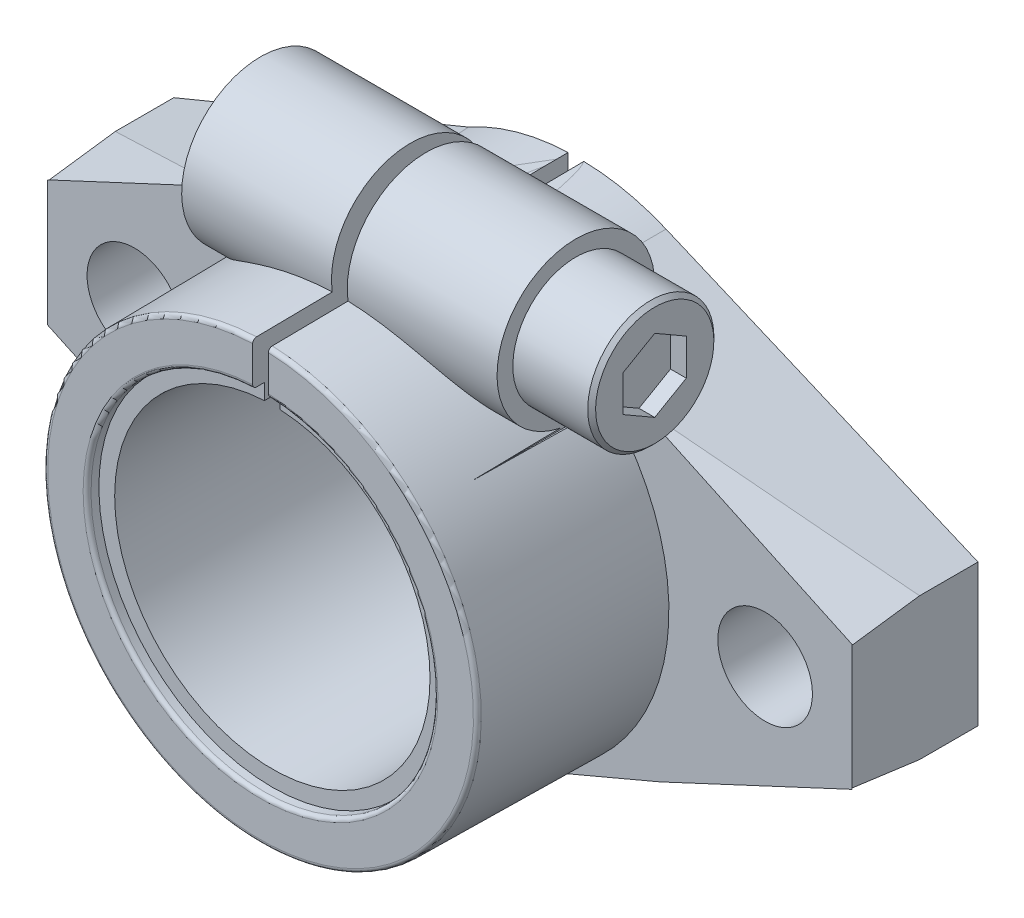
ISO-10303-21;
HEADER;
FILE_DESCRIPTION(('STEP AP214'),'2;1');
FILE_NAME('part.step','',(''),(''),'','','');
FILE_SCHEMA(('AUTOMOTIVE_DESIGN { 1 0 10303 214 1 1 1 1 }'));
ENDSEC;
DATA;
#1=APPLICATION_CONTEXT('core data for automotive mechanical design processes');
#2=APPLICATION_PROTOCOL_DEFINITION('international standard','automotive_design',2000,#1);
#3=PRODUCT_CONTEXT('',#1,'mechanical');
#4=PRODUCT('Part','Part','',(#3));
#5=PRODUCT_RELATED_PRODUCT_CATEGORY('part','',(#4));
#6=PRODUCT_DEFINITION_FORMATION('','',#4);
#7=PRODUCT_DEFINITION_CONTEXT('part definition',#1,'design');
#8=PRODUCT_DEFINITION('design','',#6,#7);
#9=PRODUCT_DEFINITION_SHAPE('','',#8);
#10=(LENGTH_UNIT() NAMED_UNIT(*) SI_UNIT(.MILLI.,.METRE.));
#11=(NAMED_UNIT(*) PLANE_ANGLE_UNIT() SI_UNIT($,.RADIAN.));
#12=(NAMED_UNIT(*) SI_UNIT($,.STERADIAN.) SOLID_ANGLE_UNIT());
#13=UNCERTAINTY_MEASURE_WITH_UNIT(LENGTH_MEASURE(1.E-05),#10,'distance_accuracy_value','');
#14=(GEOMETRIC_REPRESENTATION_CONTEXT(3) GLOBAL_UNCERTAINTY_ASSIGNED_CONTEXT((#13)) GLOBAL_UNIT_ASSIGNED_CONTEXT((#10,
#11,#12)) REPRESENTATION_CONTEXT('',''));
#15=CARTESIAN_POINT('',(0.,0.,0.));
#16=DIRECTION('',(0.,0.,1.));
#17=DIRECTION('',(1.,0.,0.));
#18=AXIS2_PLACEMENT_3D('',#15,#16,#17);
#19=CARTESIAN_POINT('',(-10.205912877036,-25.8772763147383,0.));
#20=DIRECTION('',(-0.382293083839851,-0.924041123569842,0.));
#21=DIRECTION('',(-0.924041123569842,0.382293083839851,0.));
#22=AXIS2_PLACEMENT_3D('',#19,#20,#21);
#23=PLANE('',#22);
#24=CARTESIAN_POINT('',(-13.6155565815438,-24.466642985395,0.));
#25=CARTESIAN_POINT('',(-11.905150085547,-25.1742701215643,17.0710740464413));
#26=CARTESIAN_POINT('',(-10.205912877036,-25.8772763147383,14.627636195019));
#27=(BOUNDED_CURVE() B_SPLINE_CURVE(2,(#24,#25,#26),.UNSPECIFIED.,.F.,
.F.) B_SPLINE_CURVE_WITH_KNOTS((3,3),(0.,17.4736474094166),
.UNSPECIFIED.) CURVE() GEOMETRIC_REPRESENTATION_ITEM() RATIONAL_B_SPLINE_CURVE((1.,
1.00383792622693,1.00328678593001)) REPRESENTATION_ITEM(''));
#28=CARTESIAN_POINT('',(-13.6155565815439,-24.466642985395,0.));
#29=VERTEX_POINT('',#28);
#30=CARTESIAN_POINT('',(-10.205912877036,-25.8772763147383,14.627636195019));
#31=VERTEX_POINT('',#30);
#32=EDGE_CURVE('E754',#29,#31,#27,.T.);
#33=ORIENTED_EDGE('',*,*,#32,.T.);
#34=DIRECTION('',(0.,0.,1.));
#35=VECTOR('',#34,1.);
#36=CARTESIAN_POINT('',(-10.205912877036,-25.8772763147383,0.));
#37=LINE('',#36,#35);
#38=CARTESIAN_POINT('',(-10.205912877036,-25.8772763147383,16.));
#39=VERTEX_POINT('',#38);
#40=EDGE_CURVE('E723',#31,#39,#37,.T.);
#41=ORIENTED_EDGE('',*,*,#40,.T.);
#42=DIRECTION('',(-0.924041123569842,0.382293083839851,0.));
#43=VECTOR('',#42,1.);
#44=CARTESIAN_POINT('',(-51.,-9.,16.));
#45=LINE('',#44,#43);
#46=CARTESIAN_POINT('',(-31.4903897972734,-17.0714903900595,16.));
#47=VERTEX_POINT('',#46);
#48=EDGE_CURVE('E750',#39,#47,#45,.T.);
#49=ORIENTED_EDGE('',*,*,#48,.T.);
#50=DIRECTION('',(0.924027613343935,-0.382287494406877,-0.00540753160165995));
#51=VECTOR('',#50,1.);
#52=CARTESIAN_POINT('',(-32.2971363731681,-16.7377242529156,16.0047211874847));
#53=LINE('',#52,#51);
#54=CARTESIAN_POINT('',(-28.9300178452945,-18.130764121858,15.9850163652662));
#55=VERTEX_POINT('',#54);
#56=EDGE_CURVE('E785',#47,#55,#53,.T.);
#57=ORIENTED_EDGE('',*,*,#56,.T.);
#58=DIRECTION('',(-0.869781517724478,0.359844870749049,-0.33762668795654));
#59=VECTOR('',#58,1.);
#60=CARTESIAN_POINT('',(-36.5148772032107,-14.9927660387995,13.0407701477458));
#61=LINE('',#60,#59);
#62=CARTESIAN_POINT('',(-51.,-9.,7.41802014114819));
#63=VERTEX_POINT('',#62);
#64=EDGE_CURVE('E776',#55,#63,#61,.T.);
#65=ORIENTED_EDGE('',*,*,#64,.T.);
#66=DIRECTION('',(0.,0.,1.));
#67=VECTOR('',#66,1.);
#68=CARTESIAN_POINT('',(-51.,-9.,0.));
#69=LINE('',#68,#67);
#70=CARTESIAN_POINT('',(-51.,-9.,0.));
#71=VERTEX_POINT('',#70);
#72=EDGE_CURVE('E529',#71,#63,#69,.T.);
#73=ORIENTED_EDGE('',*,*,#72,.F.);
#74=DIRECTION('',(0.924041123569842,-0.382293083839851,0.));
#75=VECTOR('',#74,1.);
#76=CARTESIAN_POINT('',(-51.,-9.,0.));
#77=LINE('',#76,#75);
#78=EDGE_CURVE('E1301',#71,#29,#77,.T.);
#79=ORIENTED_EDGE('',*,*,#78,.T.);
#80=EDGE_LOOP('',(#33,#41,#49,#57,#65,#73,#79));
#81=FACE_BOUND('',#80,.T.);
#82=ADVANCED_FACE('F55',(#81),#23,.T.);
#83=CARTESIAN_POINT('',(11.4350158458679,25.7812999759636,0.));
#84=DIRECTION('',(0.390474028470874,0.920613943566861,0.));
#85=DIRECTION('',(0.,0.,-1.));
#86=AXIS2_PLACEMENT_3D('',#83,#84,#85);
#87=PLANE('',#86);
#88=CARTESIAN_POINT('',(3.84634180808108,29.,20.));
#89=DIRECTION('',(-0.390474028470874,-0.920613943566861,0.));
#90=DIRECTION('',(-0.920613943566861,0.390474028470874,0.));
#91=AXIS2_PLACEMENT_3D('',#88,#89,#90);
#92=ELLIPSE('',#91,25.6098978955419,10.);
#93=CARTESIAN_POINT('',(25.4489832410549,19.8373423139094,15.9942910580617));
#94=VERTEX_POINT('',#93);
#95=CARTESIAN_POINT('',(25.4548626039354,19.8348486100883,16.));
#96=VERTEX_POINT('',#95);
#97=EDGE_CURVE('E545',#94,#96,#92,.T.);
#98=ORIENTED_EDGE('',*,*,#97,.T.);
#99=DIRECTION('',(0.920613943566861,-0.390474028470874,0.));
#100=VECTOR('',#99,1.);
#101=CARTESIAN_POINT('',(51.,9.,16.));
#102=LINE('',#101,#100);
#103=CARTESIAN_POINT('',(26.6657594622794,19.3212524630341,16.));
#104=VERTEX_POINT('',#103);
#105=EDGE_CURVE('E620',#96,#104,#102,.T.);
#106=ORIENTED_EDGE('',*,*,#105,.T.);
#107=DIRECTION('',(-0.920605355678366,0.390470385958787,-0.00431935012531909));
#108=VECTOR('',#107,1.);
#109=CARTESIAN_POINT('',(32.918239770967,16.6692926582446,16.0293357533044));
#110=LINE('',#109,#108);
#111=EDGE_CURVE('E824',#104,#94,#110,.T.);
#112=ORIENTED_EDGE('',*,*,#111,.T.);
#113=EDGE_LOOP('',(#98,#106,#112));
#114=FACE_BOUND('',#113,.T.);
#115=ADVANCED_FACE('F1067',(#114),#87,.T.);
#116=CARTESIAN_POINT('',(-54.7752131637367,8.09597075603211,1.09682409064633));
#117=DIRECTION('',(-0.419468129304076,0.89955230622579,0.121869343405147));
#118=DIRECTION('',(0.278996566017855,0.,0.960292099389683));
#119=AXIS2_PLACEMENT_3D('',#116,#117,#118);
#120=PLANE('',#119);
#121=DIRECTION('',(0.869781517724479,0.35984487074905,0.337626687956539));
#122=VECTOR('',#121,1.);
#123=CARTESIAN_POINT('',(-54.5868254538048,7.51606326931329,6.02570727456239));
#124=LINE('',#123,#122);
#125=CARTESIAN_POINT('',(-51.,9.,7.41802014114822));
#126=VERTEX_POINT('',#125);
#127=CARTESIAN_POINT('',(-28.9300178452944,18.130764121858,15.9850163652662));
#128=VERTEX_POINT('',#127);
#129=EDGE_CURVE('E766',#126,#128,#124,.T.);
#130=ORIENTED_EDGE('',*,*,#129,.F.);
#131=DIRECTION('',(0.,0.134251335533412,-0.990947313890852));
#132=VECTOR('',#131,1.);
#133=CARTESIAN_POINT('',(-51.,9.74354754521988,1.92968410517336));
#134=LINE('',#133,#132);
#135=CARTESIAN_POINT('',(-51.,7.83936242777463,15.9850163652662));
#136=VERTEX_POINT('',#135);
#137=EDGE_CURVE('E532',#136,#126,#134,.T.);
#138=ORIENTED_EDGE('',*,*,#137,.F.);
#139=DIRECTION('',(0.90630778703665,0.422618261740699,0.));
#140=VECTOR('',#139,1.);
#141=CARTESIAN_POINT('',(-54.0026500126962,6.43920373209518,15.9850163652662));
#142=LINE('',#141,#140);
#143=EDGE_CURVE('E828',#136,#128,#142,.T.);
#144=ORIENTED_EDGE('',*,*,#143,.T.);
#145=EDGE_LOOP('',(#130,#138,#144));
#146=FACE_BOUND('',#145,.T.);
#147=ADVANCED_FACE('F1063',(#146),#120,.T.);
#148=CARTESIAN_POINT('',(0.375817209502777,31.7962994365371,15.9850163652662));
#149=DIRECTION('',(0.0515042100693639,-0.110451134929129,0.992546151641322));
#150=DIRECTION('',(-0.90630778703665,-0.422618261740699,0.));
#151=AXIS2_PLACEMENT_3D('',#148,#149,#150);
#152=PLANE('',#151);
#153=DIRECTION('',(-0.924027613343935,-0.382287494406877,0.00540753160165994));
#154=VECTOR('',#153,1.);
#155=CARTESIAN_POINT('',(-25.0000574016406,19.7566622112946,15.9620177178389));
#156=LINE('',#155,#154);
#157=CARTESIAN_POINT('',(-31.4903897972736,17.0714903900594,16.));
#158=VERTEX_POINT('',#157);
#159=EDGE_CURVE('E770',#128,#158,#156,.T.);
#160=ORIENTED_EDGE('',*,*,#159,.F.);
#161=ORIENTED_EDGE('',*,*,#143,.F.);
#162=DIRECTION('',(0.,-0.993865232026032,-0.110597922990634));
#163=VECTOR('',#162,1.);
#164=CARTESIAN_POINT('',(-51.,10.4760870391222,16.2784326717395));
#165=LINE('',#164,#163);
#166=CARTESIAN_POINT('',(-51.,7.97400974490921,16.));
#167=VERTEX_POINT('',#166);
#168=EDGE_CURVE('E791',#167,#136,#165,.T.);
#169=ORIENTED_EDGE('',*,*,#168,.F.);
#170=DIRECTION('',(-0.90630778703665,-0.422618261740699,0.));
#171=VECTOR('',#170,1.);
#172=CARTESIAN_POINT('',(-5.91944729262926,28.9954167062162,16.));
#173=LINE('',#172,#171);
#174=EDGE_CURVE('E738',#158,#167,#173,.T.);
#175=ORIENTED_EDGE('',*,*,#174,.F.);
#176=EDGE_LOOP('',(#160,#161,#169,#175));
#177=FACE_BOUND('',#176,.T.);
#178=ADVANCED_FACE('F1066',(#177),#152,.F.);
#179=CARTESIAN_POINT('',(51.,9.,0.));
#180=DIRECTION('',(1.,0.,0.));
#181=DIRECTION('',(0.,1.,0.));
#182=AXIS2_PLACEMENT_3D('',#179,#180,#181);
#183=PLANE('',#182);
#184=DIRECTION('',(0.,-0.134251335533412,-0.990947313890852));
#185=VECTOR('',#184,1.);
#186=CARTESIAN_POINT('',(51.,-9.74354754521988,1.92968410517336));
#187=LINE('',#186,#185);
#188=CARTESIAN_POINT('',(51.,-7.83936242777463,15.9850163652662));
#189=VERTEX_POINT('',#188);
#190=CARTESIAN_POINT('',(51.,-9.,7.41802014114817));
#191=VERTEX_POINT('',#190);
#192=EDGE_CURVE('E810',#189,#191,#187,.T.);
#193=ORIENTED_EDGE('',*,*,#192,.T.);
#194=DIRECTION('',(0.,0.,1.));
#195=VECTOR('',#194,1.);
#196=CARTESIAN_POINT('',(51.,-9.,0.));
#197=LINE('',#196,#195);
#198=CARTESIAN_POINT('',(51.,-9.,0.));
#199=VERTEX_POINT('',#198);
#200=EDGE_CURVE('E814',#199,#191,#197,.T.);
#201=ORIENTED_EDGE('',*,*,#200,.F.);
#202=DIRECTION('',(0.,1.,0.));
#203=VECTOR('',#202,1.);
#204=CARTESIAN_POINT('',(51.,-9.,0.));
#205=LINE('',#204,#203);
#206=CARTESIAN_POINT('',(51.,9.,0.));
#207=VERTEX_POINT('',#206);
#208=EDGE_CURVE('E631',#199,#207,#205,.T.);
#209=ORIENTED_EDGE('',*,*,#208,.T.);
#210=DIRECTION('',(0.,0.,1.));
#211=VECTOR('',#210,1.);
#212=CARTESIAN_POINT('',(51.,9.,0.));
#213=LINE('',#212,#211);
#214=CARTESIAN_POINT('',(51.,9.,7.41802014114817));
#215=VERTEX_POINT('',#214);
#216=EDGE_CURVE('E702',#207,#215,#213,.T.);
#217=ORIENTED_EDGE('',*,*,#216,.T.);
#218=DIRECTION('',(0.,-0.134251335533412,0.990947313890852));
#219=VECTOR('',#218,1.);
#220=CARTESIAN_POINT('',(51.,9.90575833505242,0.732360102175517));
#221=LINE('',#220,#219);
#222=CARTESIAN_POINT('',(51.,7.83936242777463,15.9850163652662));
#223=VERTEX_POINT('',#222);
#224=EDGE_CURVE('E820',#215,#223,#221,.T.);
#225=ORIENTED_EDGE('',*,*,#224,.T.);
#226=DIRECTION('',(0.,0.993865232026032,0.110597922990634));
#227=VECTOR('',#226,1.);
#228=CARTESIAN_POINT('',(51.,6.84253481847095,15.8740887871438));
#229=LINE('',#228,#227);
#230=CARTESIAN_POINT('',(51.,7.9740097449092,16.));
#231=VERTEX_POINT('',#230);
#232=EDGE_CURVE('E825',#223,#231,#229,.T.);
#233=ORIENTED_EDGE('',*,*,#232,.T.);
#234=DIRECTION('',(0.,-1.,0.));
#235=VECTOR('',#234,1.);
#236=CARTESIAN_POINT('',(51.,-9.,16.));
#237=LINE('',#236,#235);
#238=CARTESIAN_POINT('',(51.,-7.97400974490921,16.));
#239=VERTEX_POINT('',#238);
#240=EDGE_CURVE('E621',#231,#239,#237,.T.);
#241=ORIENTED_EDGE('',*,*,#240,.T.);
#242=DIRECTION('',(0.,0.993865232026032,-0.110597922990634));
#243=VECTOR('',#242,1.);
#244=CARTESIAN_POINT('',(51.,-10.4760870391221,16.2784326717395));
#245=LINE('',#244,#243);
#246=EDGE_CURVE('E803',#239,#189,#245,.T.);
#247=ORIENTED_EDGE('',*,*,#246,.T.);
#248=EDGE_LOOP('',(#193,#201,#209,#217,#225,#233,#241,#247));
#249=FACE_BOUND('',#248,.T.);
#250=ADVANCED_FACE('F1549',(#249),#183,.T.);
#251=CARTESIAN_POINT('',(54.0026500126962,6.43920373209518,15.9850163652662));
#252=DIRECTION('',(-0.0515042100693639,-0.110451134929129,0.992546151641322));
#253=DIRECTION('',(-0.90630778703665,0.422618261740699,0.));
#254=AXIS2_PLACEMENT_3D('',#251,#252,#253);
#255=PLANE('',#254);
#256=CARTESIAN_POINT('',(82.9942800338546,29.,20.));
#257=DIRECTION('',(-0.0515042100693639,-0.110451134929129,0.992546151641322));
#258=DIRECTION('',(-0.998672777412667,0.00569625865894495,-0.0511882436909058));
#259=AXIS2_PLACEMENT_3D('',#256,#257,#258);
#260=ELLIPSE('',#259,194.158885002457,10.);
#261=CARTESIAN_POINT('',(25.2615417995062,19.8414025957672,15.9850163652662));
#262=VERTEX_POINT('',#261);
#263=EDGE_CURVE('E681',#262,#94,#260,.T.);
#264=ORIENTED_EDGE('',*,*,#263,.T.);
#265=ORIENTED_EDGE('',*,*,#111,.F.);
#266=DIRECTION('',(-0.90630778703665,0.422618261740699,0.));
#267=VECTOR('',#266,1.);
#268=CARTESIAN_POINT('',(33.1086809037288,16.3168688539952,16.));
#269=LINE('',#268,#267);
#270=EDGE_CURVE('E616',#231,#104,#269,.T.);
#271=ORIENTED_EDGE('',*,*,#270,.F.);
#272=ORIENTED_EDGE('',*,*,#232,.F.);
#273=DIRECTION('',(-0.90630778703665,0.422618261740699,0.));
#274=VECTOR('',#273,1.);
#275=CARTESIAN_POINT('',(54.0026500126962,6.43920373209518,15.9850163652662));
#276=LINE('',#275,#274);
#277=EDGE_CURVE('E817',#223,#262,#276,.T.);
#278=ORIENTED_EDGE('',*,*,#277,.T.);
#279=EDGE_LOOP('',(#264,#265,#271,#272,#278));
#280=FACE_BOUND('',#279,.T.);
#281=ADVANCED_FACE('F1566',(#280),#255,.F.);
#282=CARTESIAN_POINT('',(54.7752131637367,8.09597075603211,1.09682409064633));
#283=DIRECTION('',(-0.419468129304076,-0.89955230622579,-0.121869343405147));
#284=DIRECTION('',(-0.90630778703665,0.422618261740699,0.));
#285=AXIS2_PLACEMENT_3D('',#282,#283,#284);
#286=PLANE('',#285);
#287=CARTESIAN_POINT('',(4.45438095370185,29.,20.));
#288=DIRECTION('',(-0.419468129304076,-0.89955230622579,-0.121869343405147));
#289=DIRECTION('',(-0.907770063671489,0.415670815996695,0.056314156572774));
#290=AXIS2_PLACEMENT_3D('',#287,#288,#289);
#291=ELLIPSE('',#290,23.8397134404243,10.);
#292=CARTESIAN_POINT('',(24.9359933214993,20.0549245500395,15.529471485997));
#293=VERTEX_POINT('',#292);
#294=EDGE_CURVE('E682',#293,#262,#291,.T.);
#295=ORIENTED_EDGE('',*,*,#294,.T.);
#296=ORIENTED_EDGE('',*,*,#277,.F.);
#297=ORIENTED_EDGE('',*,*,#224,.F.);
#298=DIRECTION('',(0.8850068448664,-0.375371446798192,-0.275425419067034));
#299=VECTOR('',#298,1.);
#300=CARTESIAN_POINT('',(36.0212870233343,15.353149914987,12.0795866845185));
#301=LINE('',#300,#299);
#302=EDGE_CURVE('E698',#293,#215,#301,.T.);
#303=ORIENTED_EDGE('',*,*,#302,.F.);
#304=EDGE_LOOP('',(#295,#296,#297,#303));
#305=FACE_BOUND('',#304,.T.);
#306=ADVANCED_FACE('F857',(#305),#286,.F.);
#307=CARTESIAN_POINT('',(51.,-9.,0.));
#308=DIRECTION('',(0.390474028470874,-0.920613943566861,0.));
#309=DIRECTION('',(0.,0.,-1.));
#310=AXIS2_PLACEMENT_3D('',#307,#308,#309);
#311=PLANE('',#310);
#312=DIRECTION('',(-0.885006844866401,-0.375371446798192,0.275425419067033));
#313=VECTOR('',#312,1.);
#314=CARTESIAN_POINT('',(54.3030958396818,-7.5990075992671,6.39005458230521));
#315=LINE('',#314,#313);
#316=CARTESIAN_POINT('',(23.4722201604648,-20.6757769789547,15.9850163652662));
#317=VERTEX_POINT('',#316);
#318=EDGE_CURVE('E807',#191,#317,#315,.T.);
#319=ORIENTED_EDGE('',*,*,#318,.T.);
#320=DIRECTION('',(0.920605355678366,0.390470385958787,0.00431935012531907));
#321=VECTOR('',#320,1.);
#322=CARTESIAN_POINT('',(25.0995540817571,-19.9855510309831,15.9926515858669));
#323=LINE('',#322,#321);
#324=CARTESIAN_POINT('',(26.6657594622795,-19.3212524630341,16.));
#325=VERTEX_POINT('',#324);
#326=EDGE_CURVE('E531',#317,#325,#323,.T.);
#327=ORIENTED_EDGE('',*,*,#326,.T.);
#328=DIRECTION('',(-0.920613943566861,-0.390474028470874,0.));
#329=VECTOR('',#328,1.);
#330=CARTESIAN_POINT('',(11.4350158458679,-25.7812999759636,16.));
#331=LINE('',#330,#329);
#332=CARTESIAN_POINT('',(11.4350158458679,-25.7812999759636,16.));
#333=VERTEX_POINT('',#332);
#334=EDGE_CURVE('E523',#325,#333,#331,.T.);
#335=ORIENTED_EDGE('',*,*,#334,.T.);
#336=DIRECTION('',(0.,0.,1.));
#337=VECTOR('',#336,1.);
#338=CARTESIAN_POINT('',(11.4350158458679,-25.7812999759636,0.));
#339=LINE('',#338,#337);
#340=CARTESIAN_POINT('',(11.4350158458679,-25.7812999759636,0.));
#341=VERTEX_POINT('',#340);
#342=EDGE_CURVE('E773',#341,#333,#339,.T.);
#343=ORIENTED_EDGE('',*,*,#342,.F.);
#344=DIRECTION('',(0.920613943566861,0.390474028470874,0.));
#345=VECTOR('',#344,1.);
#346=CARTESIAN_POINT('',(11.4350158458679,-25.7812999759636,0.));
#347=LINE('',#346,#345);
#348=EDGE_CURVE('E626',#341,#199,#347,.T.);
#349=ORIENTED_EDGE('',*,*,#348,.T.);
#350=ORIENTED_EDGE('',*,*,#200,.T.);
#351=EDGE_LOOP('',(#319,#327,#335,#343,#349,#350));
#352=FACE_BOUND('',#351,.T.);
#353=ADVANCED_FACE('F1578',(#352),#311,.T.);
#354=CARTESIAN_POINT('',(54.7752131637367,-8.09597075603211,1.09682409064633));
#355=DIRECTION('',(-0.419468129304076,0.89955230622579,-0.121869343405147));
#356=DIRECTION('',(-0.278996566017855,0.,0.960292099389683));
#357=AXIS2_PLACEMENT_3D('',#354,#355,#356);
#358=PLANE('',#357);
#359=ORIENTED_EDGE('',*,*,#318,.F.);
#360=ORIENTED_EDGE('',*,*,#192,.F.);
#361=DIRECTION('',(0.90630778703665,0.422618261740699,0.));
#362=VECTOR('',#361,1.);
#363=CARTESIAN_POINT('',(-0.375817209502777,-31.7962994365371,15.9850163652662));
#364=LINE('',#363,#362);
#365=EDGE_CURVE('E799',#317,#189,#364,.T.);
#366=ORIENTED_EDGE('',*,*,#365,.F.);
#367=EDGE_LOOP('',(#359,#360,#366));
#368=FACE_BOUND('',#367,.T.);
#369=ADVANCED_FACE('F1583',(#368),#358,.F.);
#370=CARTESIAN_POINT('',(-0.375817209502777,-31.7962994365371,15.9850163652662));
#371=DIRECTION('',(-0.0515042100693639,0.110451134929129,0.992546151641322));
#372=DIRECTION('',(0.90630778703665,0.422618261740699,0.));
#373=AXIS2_PLACEMENT_3D('',#370,#371,#372);
#374=PLANE('',#373);
#375=ORIENTED_EDGE('',*,*,#326,.F.);
#376=ORIENTED_EDGE('',*,*,#365,.T.);
#377=ORIENTED_EDGE('',*,*,#246,.F.);
#378=DIRECTION('',(0.90630778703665,0.422618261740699,0.));
#379=VECTOR('',#378,1.);
#380=CARTESIAN_POINT('',(5.91944729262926,-28.9954167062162,16.));
#381=LINE('',#380,#379);
#382=EDGE_CURVE('E527',#325,#239,#381,.T.);
#383=ORIENTED_EDGE('',*,*,#382,.F.);
#384=EDGE_LOOP('',(#375,#376,#377,#383));
#385=FACE_BOUND('',#384,.T.);
#386=ADVANCED_FACE('F1594',(#385),#374,.F.);
#387=CARTESIAN_POINT('',(-51.,-9.,0.));
#388=DIRECTION('',(-1.,0.,0.));
#389=DIRECTION('',(0.,0.,1.));
#390=AXIS2_PLACEMENT_3D('',#387,#388,#389);
#391=PLANE('',#390);
#392=DIRECTION('',(0.,0.134251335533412,0.990947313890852));
#393=VECTOR('',#392,1.);
#394=CARTESIAN_POINT('',(-51.,-9.90575833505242,0.732360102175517));
#395=LINE('',#394,#393);
#396=CARTESIAN_POINT('',(-51.,-7.83936242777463,15.9850163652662));
#397=VERTEX_POINT('',#396);
#398=EDGE_CURVE('E784',#63,#397,#395,.T.);
#399=ORIENTED_EDGE('',*,*,#398,.T.);
#400=DIRECTION('',(0.,-0.993865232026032,0.110597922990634));
#401=VECTOR('',#400,1.);
#402=CARTESIAN_POINT('',(-51.,-6.84253481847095,15.8740887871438));
#403=LINE('',#402,#401);
#404=CARTESIAN_POINT('',(-51.,-7.9740097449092,16.));
#405=VERTEX_POINT('',#404);
#406=EDGE_CURVE('E788',#397,#405,#403,.T.);
#407=ORIENTED_EDGE('',*,*,#406,.T.);
#408=DIRECTION('',(0.,1.,0.));
#409=VECTOR('',#408,1.);
#410=CARTESIAN_POINT('',(-51.,9.,16.));
#411=LINE('',#410,#409);
#412=EDGE_CURVE('E742',#405,#167,#411,.T.);
#413=ORIENTED_EDGE('',*,*,#412,.T.);
#414=ORIENTED_EDGE('',*,*,#168,.T.);
#415=ORIENTED_EDGE('',*,*,#137,.T.);
#416=DIRECTION('',(0.,0.,1.));
#417=VECTOR('',#416,1.);
#418=CARTESIAN_POINT('',(-51.,9.,0.));
#419=LINE('',#418,#417);
#420=CARTESIAN_POINT('',(-51.,9.,0.));
#421=VERTEX_POINT('',#420);
#422=EDGE_CURVE('E759',#421,#126,#419,.T.);
#423=ORIENTED_EDGE('',*,*,#422,.F.);
#424=DIRECTION('',(0.,-1.,0.));
#425=VECTOR('',#424,1.);
#426=CARTESIAN_POINT('',(-51.,9.,0.));
#427=LINE('',#426,#425);
#428=EDGE_CURVE('E673',#421,#71,#427,.T.);
#429=ORIENTED_EDGE('',*,*,#428,.T.);
#430=ORIENTED_EDGE('',*,*,#72,.T.);
#431=EDGE_LOOP('',(#399,#407,#413,#414,#415,#423,#429,#430));
#432=FACE_BOUND('',#431,.T.);
#433=ADVANCED_FACE('F918',(#432),#391,.T.);
#434=CARTESIAN_POINT('',(-54.0026500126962,-6.43920373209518,15.9850163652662));
#435=DIRECTION('',(0.0515042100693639,0.110451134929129,0.992546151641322));
#436=DIRECTION('',(0.90630778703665,-0.422618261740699,0.));
#437=AXIS2_PLACEMENT_3D('',#434,#435,#436);
#438=PLANE('',#437);
#439=ORIENTED_EDGE('',*,*,#56,.F.);
#440=DIRECTION('',(0.90630778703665,-0.422618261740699,0.));
#441=VECTOR('',#440,1.);
#442=CARTESIAN_POINT('',(-33.1086809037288,-16.3168688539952,16.));
#443=LINE('',#442,#441);
#444=EDGE_CURVE('E746',#405,#47,#443,.T.);
#445=ORIENTED_EDGE('',*,*,#444,.F.);
#446=ORIENTED_EDGE('',*,*,#406,.F.);
#447=DIRECTION('',(-0.90630778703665,0.422618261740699,0.));
#448=VECTOR('',#447,1.);
#449=CARTESIAN_POINT('',(0.375817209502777,-31.7962994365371,15.9850163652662));
#450=LINE('',#449,#448);
#451=EDGE_CURVE('E780',#55,#397,#450,.T.);
#452=ORIENTED_EDGE('',*,*,#451,.F.);
#453=EDGE_LOOP('',(#439,#445,#446,#452));
#454=FACE_BOUND('',#453,.T.);
#455=ADVANCED_FACE('F1612',(#454),#438,.F.);
#456=CARTESIAN_POINT('',(-54.7752131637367,-8.09597075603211,1.09682409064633));
#457=DIRECTION('',(-0.419468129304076,-0.89955230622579,0.121869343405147));
#458=DIRECTION('',(-0.90630778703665,0.422618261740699,0.));
#459=AXIS2_PLACEMENT_3D('',#456,#457,#458);
#460=PLANE('',#459);
#461=ORIENTED_EDGE('',*,*,#64,.F.);
#462=ORIENTED_EDGE('',*,*,#451,.T.);
#463=ORIENTED_EDGE('',*,*,#398,.F.);
#464=EDGE_LOOP('',(#461,#462,#463));
#465=FACE_BOUND('',#464,.T.);
#466=ADVANCED_FACE('F1617',(#465),#460,.T.);
#467=CARTESIAN_POINT('',(0.500000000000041,0.,0.));
#468=DIRECTION('',(0.,0.,-1.));
#469=DIRECTION('',(-0.382293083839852,-0.924041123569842,0.));
#470=AXIS2_PLACEMENT_3D('',#467,#468,#469);
#471=CYLINDRICAL_SURFACE('',#470,28.0044639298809);
#472=CARTESIAN_POINT('',(0.500000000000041,0.,2240.));
#473=DIRECTION('',(0.,0.999921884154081,-0.012499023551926));
#474=DIRECTION('',(0.,-0.012499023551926,-0.999921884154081));
#475=AXIS2_PLACEMENT_3D('',#472,#473,#474);
#476=ELLIPSE('',#475,2240.53213545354,28.0044639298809);
#477=CARTESIAN_POINT('',(3.87786915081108,-27.8,16.));
#478=VERTEX_POINT('',#477);
#479=CARTESIAN_POINT('',(1.00000000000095,-28.,0.));
#480=VERTEX_POINT('',#479);
#481=EDGE_CURVE('E714',#478,#480,#476,.T.);
#482=ORIENTED_EDGE('',*,*,#481,.T.);
#483=CARTESIAN_POINT('',(0.500000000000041,0.,0.));
#484=DIRECTION('',(0.,0.,1.));
#485=DIRECTION('',(-0.382293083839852,-0.924041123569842,0.));
#486=AXIS2_PLACEMENT_3D('',#483,#484,#485);
#487=CIRCLE('',#486,28.0044639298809);
#488=EDGE_CURVE('E630',#480,#341,#487,.T.);
#489=ORIENTED_EDGE('',*,*,#488,.T.);
#490=ORIENTED_EDGE('',*,*,#342,.T.);
#491=CARTESIAN_POINT('',(0.500000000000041,0.,16.));
#492=DIRECTION('',(0.,0.,-1.));
#493=DIRECTION('',(-0.382293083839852,-0.924041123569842,0.));
#494=AXIS2_PLACEMENT_3D('',#491,#492,#493);
#495=CIRCLE('',#494,28.0044639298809);
#496=EDGE_CURVE('E528',#333,#478,#495,.T.);
#497=ORIENTED_EDGE('',*,*,#496,.T.);
#498=EDGE_LOOP('',(#482,#489,#490,#497));
#499=FACE_BOUND('',#498,.T.);
#500=ADVANCED_FACE('F1631',(#499),#471,.T.);
#501=CARTESIAN_POINT('',(-51.,9.,0.));
#502=DIRECTION('',(-0.382293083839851,0.924041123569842,0.));
#503=DIRECTION('',(0.,0.,1.));
#504=AXIS2_PLACEMENT_3D('',#501,#502,#503);
#505=PLANE('',#504);
#506=CARTESIAN_POINT('',(-2.65797328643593,29.,20.));
#507=DIRECTION('',(0.382293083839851,-0.924041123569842,0.));
#508=DIRECTION('',(0.924041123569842,0.382293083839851,0.));
#509=AXIS2_PLACEMENT_3D('',#506,#507,#508);
#510=ELLIPSE('',#509,26.157941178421,10.);
#511=CARTESIAN_POINT('',(-24.8110729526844,19.8348486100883,16.));
#512=VERTEX_POINT('',#511);
#513=CARTESIAN_POINT('',(-20.,21.825279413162,13.034127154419));
#514=VERTEX_POINT('',#513);
#515=EDGE_CURVE('E547',#512,#514,#510,.T.);
#516=ORIENTED_EDGE('',*,*,#515,.T.);
#517=CARTESIAN_POINT('',(-2.65797328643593,29.,20.));
#518=DIRECTION('',(0.382293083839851,-0.924041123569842,0.));
#519=DIRECTION('',(0.924041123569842,0.382293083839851,0.));
#520=AXIS2_PLACEMENT_3D('',#517,#518,#519);
#521=ELLIPSE('',#520,26.157941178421,10.);
#522=CARTESIAN_POINT('',(-12.1980824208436,25.0530785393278,10.8118657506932));
#523=VERTEX_POINT('',#522);
#524=EDGE_CURVE('E1013',#514,#523,#521,.T.);
#525=ORIENTED_EDGE('',*,*,#524,.T.);
#526=CARTESIAN_POINT('',(-12.1980824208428,25.0530785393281,10.8118657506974));
#527=CARTESIAN_POINT('',(-12.9051049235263,24.7605701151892,7.09081314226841));
#528=CARTESIAN_POINT('',(-13.6155565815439,24.466642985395,0.));
#529=(BOUNDED_CURVE() B_SPLINE_CURVE(2,(#526,#527,#528),.UNSPECIFIED.,.F.,
.F.) B_SPLINE_CURVE_WITH_KNOTS((3,3),(23.3171402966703,30.5589214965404),
.UNSPECIFIED.) CURVE() GEOMETRIC_REPRESENTATION_ITEM() RATIONAL_B_SPLINE_CURVE((1.00242731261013,
1.00159059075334,1.)) REPRESENTATION_ITEM(''));
#530=CARTESIAN_POINT('',(-13.6155565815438,24.466642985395,0.));
#531=VERTEX_POINT('',#530);
#532=EDGE_CURVE('E573',#523,#531,#529,.T.);
#533=ORIENTED_EDGE('',*,*,#532,.T.);
#534=DIRECTION('',(-0.924041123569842,-0.382293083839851,0.));
#535=VECTOR('',#534,1.);
#536=CARTESIAN_POINT('',(-10.205912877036,25.8772763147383,0.));
#537=LINE('',#536,#535);
#538=EDGE_CURVE('E611',#531,#421,#537,.T.);
#539=ORIENTED_EDGE('',*,*,#538,.T.);
#540=ORIENTED_EDGE('',*,*,#422,.T.);
#541=ORIENTED_EDGE('',*,*,#129,.T.);
#542=ORIENTED_EDGE('',*,*,#159,.T.);
#543=DIRECTION('',(0.924041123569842,0.382293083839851,0.));
#544=VECTOR('',#543,1.);
#545=CARTESIAN_POINT('',(-10.205912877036,25.8772763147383,16.));
#546=LINE('',#545,#544);
#547=EDGE_CURVE('E732',#158,#512,#546,.T.);
#548=ORIENTED_EDGE('',*,*,#547,.T.);
#549=EDGE_LOOP('',(#516,#525,#533,#539,#540,#541,#542,#548));
#550=FACE_BOUND('',#549,.T.);
#551=ADVANCED_FACE('F1625',(#550),#505,.T.);
#552=CARTESIAN_POINT('',(0.,13.75,40.));
#553=DIRECTION('',(0.,0.,1.));
#554=DIRECTION('',(1.,0.,0.));
#555=AXIS2_PLACEMENT_3D('',#552,#553,#554);
#556=PLANE('',#555);
#557=DIRECTION('',(0.,1.,0.));
#558=VECTOR('',#557,1.);
#559=CARTESIAN_POINT('',(-1.,6.875,40.));
#560=LINE('',#559,#558);
#561=CARTESIAN_POINT('',(-1.,22.477766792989,40.));
#562=VERTEX_POINT('',#561);
#563=CARTESIAN_POINT('',(-1.,26.987690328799,40.));
#564=VERTEX_POINT('',#563);
#565=EDGE_CURVE('E652',#562,#564,#560,.T.);
#566=ORIENTED_EDGE('',*,*,#565,.T.);
#567=CARTESIAN_POINT('',(0.,0.,40.));
#568=DIRECTION('',(0.,0.,1.));
#569=DIRECTION('',(1.,0.,0.));
#570=AXIS2_PLACEMENT_3D('',#567,#568,#569);
#571=CIRCLE('',#570,27.0062109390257);
#572=CARTESIAN_POINT('',(1.,26.987690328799,40.));
#573=VERTEX_POINT('',#572);
#574=EDGE_CURVE('E2892',#564,#573,#571,.T.);
#575=ORIENTED_EDGE('',*,*,#574,.T.);
#576=DIRECTION('',(0.,-1.,0.));
#577=VECTOR('',#576,1.);
#578=CARTESIAN_POINT('',(1.,24.375,40.));
#579=LINE('',#578,#577);
#580=CARTESIAN_POINT('',(1.,22.477766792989,40.));
#581=VERTEX_POINT('',#580);
#582=EDGE_CURVE('E689',#573,#581,#579,.T.);
#583=ORIENTED_EDGE('',*,*,#582,.T.);
#584=CARTESIAN_POINT('',(0.,0.,40.));
#585=DIRECTION('',(0.,0.,1.));
#586=DIRECTION('',(1.,0.,0.));
#587=AXIS2_PLACEMENT_3D('',#584,#585,#586);
#588=CIRCLE('',#587,22.5);
#589=EDGE_CURVE('E1409',#581,#562,#588,.F.);
#590=ORIENTED_EDGE('',*,*,#589,.T.);
#591=EDGE_LOOP('',(#566,#575,#583,#590));
#592=FACE_BOUND('',#591,.T.);
#593=ADVANCED_FACE('F1630',(#592),#556,.T.);
#594=CARTESIAN_POINT('',(0.,0.,20.));
#595=DIRECTION('',(0.,0.,-1.));
#596=DIRECTION('',(0.,1.,0.));
#597=AXIS2_PLACEMENT_3D('',#594,#595,#596);
#598=CONICAL_SURFACE('',#597,27.75,0.0124993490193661);
#599=ORIENTED_EDGE('',*,*,#32,.F.);
#600=CARTESIAN_POINT('',(0.,0.,0.));
#601=DIRECTION('',(0.,0.,1.));
#602=DIRECTION('',(0.,1.,0.));
#603=AXIS2_PLACEMENT_3D('',#600,#601,#602);
#604=CIRCLE('',#603,28.);
#605=CARTESIAN_POINT('',(-8.68638494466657E-13,-28.,0.));
#606=VERTEX_POINT('',#605);
#607=EDGE_CURVE('E666',#29,#606,#604,.T.);
#608=ORIENTED_EDGE('',*,*,#607,.T.);
#609=CARTESIAN_POINT('',(-10.205912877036,-25.8772763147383,14.627636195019));
#610=CARTESIAN_POINT('',(-9.93938231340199,-25.9875449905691,14.2443754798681));
#611=CARTESIAN_POINT('',(-9.66989332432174,-26.0942103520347,13.8569547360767));
#612=CARTESIAN_POINT('',(-9.39789536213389,-26.1969782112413,13.4660374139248));
#613=CARTESIAN_POINT('',(-9.2143160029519,-26.2663392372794,13.2021959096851));
#614=CARTESIAN_POINT('',(-9.02959428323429,-26.3339257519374,12.9367616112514));
#615=CARTESIAN_POINT('',(-8.8438745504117,-26.399659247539,12.6699384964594));
#616=CARTESIAN_POINT('',(-8.56528743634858,-26.498262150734,12.2696930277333));
#617=CARTESIAN_POINT('',(-8.28445126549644,-26.5926943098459,11.8663191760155));
#618=CARTESIAN_POINT('',(-8.00184483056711,-26.6827403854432,11.4605200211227));
#619=CARTESIAN_POINT('',(-7.7551697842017,-26.7613377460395,11.1063153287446));
#620=CARTESIAN_POINT('',(-7.50714643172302,-26.8365941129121,10.7502628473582));
#621=CARTESIAN_POINT('',(-7.25810438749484,-26.9083967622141,10.3928301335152));
#622=CARTESIAN_POINT('',(-6.96979754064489,-26.9915200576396,9.97904338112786));
#623=CARTESIAN_POINT('',(-6.68012363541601,-27.0700142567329,9.56340695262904));
#624=CARTESIAN_POINT('',(-6.38959084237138,-27.1437568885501,9.14665874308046));
#625=CARTESIAN_POINT('',(-6.14163771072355,-27.2066920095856,8.79098796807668));
#626=CARTESIAN_POINT('',(-5.89305932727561,-27.2661670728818,8.43450741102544));
#627=CARTESIAN_POINT('',(-5.64417790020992,-27.322135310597,8.07767576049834));
#628=CARTESIAN_POINT('',(-5.35036422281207,-27.3882078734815,7.65642287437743));
#629=CARTESIAN_POINT('',(-5.05611019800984,-27.4493959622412,7.23465720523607));
#630=CARTESIAN_POINT('',(-4.76194633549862,-27.5056707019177,6.81314118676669));
#631=CARTESIAN_POINT('',(-4.5149640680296,-27.5529194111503,6.4592330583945));
#632=CARTESIAN_POINT('',(-4.2680455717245,-27.5967054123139,6.1055009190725));
#633=CARTESIAN_POINT('',(-4.02150690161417,-27.6370399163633,5.75239603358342));
#634=CARTESIAN_POINT('',(-3.72663812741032,-27.6852813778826,5.3300703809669));
#635=CARTESIAN_POINT('',(-3.43231130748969,-27.7285844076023,4.9086420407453));
#636=CARTESIAN_POINT('',(-3.13907330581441,-27.767015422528,4.48888935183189));
#637=CARTESIAN_POINT('',(-2.89512454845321,-27.7989867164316,4.13969127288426));
#638=CARTESIAN_POINT('',(-2.65192941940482,-27.8275871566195,3.7916528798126));
#639=CARTESIAN_POINT('',(-2.40980099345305,-27.8528824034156,3.44522230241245));
#640=CARTESIAN_POINT('',(-2.11791229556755,-27.8833761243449,3.02759612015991));
#641=CARTESIAN_POINT('',(-1.82757107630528,-27.9090654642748,2.61230421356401));
#642=CARTESIAN_POINT('',(-1.53933630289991,-27.9301111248,2.20013509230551));
#643=CARTESIAN_POINT('',(-1.30106721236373,-27.9475085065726,1.85941575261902));
#644=CARTESIAN_POINT('',(-1.0642375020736,-27.9617336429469,1.52083036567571));
#645=CARTESIAN_POINT('',(-0.829157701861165,-27.9729036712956,1.18482435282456));
#646=CARTESIAN_POINT('',(-0.550128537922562,-27.9861619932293,0.786000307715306));
#647=CARTESIAN_POINT('',(-0.273567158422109,-27.9951148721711,0.39081022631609));
#648=CARTESIAN_POINT('',(-8.6852747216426E-13,-28.,0.));
#649=(BOUNDED_CURVE() B_SPLINE_CURVE(3,(#609,#610,#611,#612,#613,#614,#615,#616,#617,#618,#619,
#620,#621,#622,#623,#624,#625,#626,#627,#628,#629,#630,#631,#632,#633,#634,#635,#636,#637,#638,
#639,#640,#641,#642,#643,#644,#645,#646,#647,#648),.UNSPECIFIED.,.F.,
.F.) B_SPLINE_CURVE_WITH_KNOTS((4,3,3,3,3,3,3,3,3,3,3,3,3,4),(2.91385842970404,4.29006560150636,
5.21890796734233,6.61220910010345,7.8283619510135,9.23625753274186,10.4378159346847,
11.8562998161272,13.0472699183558,14.4717113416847,15.656723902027,17.0852706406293,
18.2661778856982,19.6678617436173),
.UNSPECIFIED.) CURVE() GEOMETRIC_REPRESENTATION_ITEM() RATIONAL_B_SPLINE_CURVE((1.,1.,1.,1.,1.,
1.,1.,1.,1.,1.,1.,1.,1.,1.,1.,1.,1.,1.,1.,1.,1.,1.,1.,1.,1.,1.,1.,1.,1.,1.,1.,1.,1.,1.,1.,1.,1.,
1.,1.,1.)) REPRESENTATION_ITEM(''));
#650=EDGE_CURVE('E727',#31,#606,#649,.T.);
#651=ORIENTED_EDGE('',*,*,#650,.F.);
#652=EDGE_LOOP('',(#599,#608,#651));
#653=FACE_BOUND('',#652,.T.);
#654=ADVANCED_FACE('F1644',(#653),#598,.T.);
#655=CARTESIAN_POINT('',(0.,0.,16.));
#656=DIRECTION('',(0.,0.,1.));
#657=DIRECTION('',(1.,0.,0.));
#658=AXIS2_PLACEMENT_3D('',#655,#656,#657);
#659=PLANE('',#658);
#660=CARTESIAN_POINT('',(-40.,0.,16.));
#661=DIRECTION('',(0.,0.,-1.));
#662=DIRECTION('',(0.,1.,0.));
#663=AXIS2_PLACEMENT_3D('',#660,#661,#662);
#664=CIRCLE('',#663,6.);
#665=CARTESIAN_POINT('',(-40.,-6.,16.));
#666=VERTEX_POINT('',#665);
#667=EDGE_CURVE('E1283',#666,#666,#664,.T.);
#668=ORIENTED_EDGE('',*,*,#667,.T.);
#669=EDGE_LOOP('',(#668));
#670=FACE_BOUND('',#669,.T.);
#671=DIRECTION('',(-1.,0.,0.));
#672=VECTOR('',#671,1.);
#673=CARTESIAN_POINT('',(-20.,19.8348486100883,16.));
#674=LINE('',#673,#672);
#675=CARTESIAN_POINT('',(-19.4786750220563,19.8348486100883,16.));
#676=VERTEX_POINT('',#675);
#677=CARTESIAN_POINT('',(-20.,19.8348486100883,16.));
#678=VERTEX_POINT('',#677);
#679=EDGE_CURVE('E2499',#676,#678,#674,.T.);
#680=ORIENTED_EDGE('',*,*,#679,.T.);
#681=DIRECTION('',(-1.,0.,0.));
#682=VECTOR('',#681,1.);
#683=CARTESIAN_POINT('',(-20.,19.8348486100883,16.));
#684=LINE('',#683,#682);
#685=EDGE_CURVE('E550',#678,#512,#684,.T.);
#686=ORIENTED_EDGE('',*,*,#685,.T.);
#687=ORIENTED_EDGE('',*,*,#547,.F.);
#688=ORIENTED_EDGE('',*,*,#174,.T.);
#689=ORIENTED_EDGE('',*,*,#412,.F.);
#690=ORIENTED_EDGE('',*,*,#444,.T.);
#691=ORIENTED_EDGE('',*,*,#48,.F.);
#692=CARTESIAN_POINT('',(0.500000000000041,0.,16.));
#693=DIRECTION('',(0.,0.,-1.));
#694=DIRECTION('',(-0.382293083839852,-0.924041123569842,0.));
#695=AXIS2_PLACEMENT_3D('',#692,#693,#694);
#696=CIRCLE('',#695,28.0044639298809);
#697=CARTESIAN_POINT('',(-2.877869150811,-27.8,16.));
#698=VERTEX_POINT('',#697);
#699=EDGE_CURVE('E719',#698,#39,#696,.T.);
#700=ORIENTED_EDGE('',*,*,#699,.F.);
#701=DIRECTION('',(1.,0.,0.));
#702=VECTOR('',#701,1.);
#703=CARTESIAN_POINT('',(5.,-27.8,16.));
#704=LINE('',#703,#702);
#705=CARTESIAN_POINT('',(0.,-27.8,16.));
#706=VERTEX_POINT('',#705);
#707=EDGE_CURVE('E715',#698,#706,#704,.T.);
#708=ORIENTED_EDGE('',*,*,#707,.T.);
#709=CARTESIAN_POINT('',(0.,0.,16.));
#710=DIRECTION('',(0.,0.,-1.));
#711=DIRECTION('',(0.,1.,0.));
#712=AXIS2_PLACEMENT_3D('',#709,#710,#711);
#713=CIRCLE('',#712,27.8);
#714=EDGE_CURVE('E1177',#706,#676,#713,.T.);
#715=ORIENTED_EDGE('',*,*,#714,.T.);
#716=EDGE_LOOP('',(#680,#686,#687,#688,#689,#690,#691,#700,#708,#715));
#717=FACE_BOUND('',#716,.T.);
#718=ADVANCED_FACE('F1656',(#670,#717),#659,.T.);
#719=CARTESIAN_POINT('',(0.500000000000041,0.,0.));
#720=DIRECTION('',(0.,0.,-1.));
#721=DIRECTION('',(-0.382293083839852,-0.924041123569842,0.));
#722=AXIS2_PLACEMENT_3D('',#719,#720,#721);
#723=CYLINDRICAL_SURFACE('',#722,28.0044639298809);
#724=CARTESIAN_POINT('',(0.500000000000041,0.,2240.));
#725=DIRECTION('',(0.,0.999921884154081,-0.012499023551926));
#726=DIRECTION('',(0.,-0.012499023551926,-0.999921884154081));
#727=AXIS2_PLACEMENT_3D('',#724,#725,#726);
#728=ELLIPSE('',#727,2240.53213545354,28.0044639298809);
#729=EDGE_CURVE('E718',#606,#698,#728,.T.);
#730=ORIENTED_EDGE('',*,*,#729,.T.);
#731=ORIENTED_EDGE('',*,*,#699,.T.);
#732=ORIENTED_EDGE('',*,*,#40,.F.);
#733=ORIENTED_EDGE('',*,*,#650,.T.);
#734=EDGE_LOOP('',(#730,#731,#732,#733));
#735=FACE_BOUND('',#734,.T.);
#736=ADVANCED_FACE('F1663',(#735),#723,.T.);
#737=CARTESIAN_POINT('',(10.,-28.,0.));
#738=DIRECTION('',(0.,0.999921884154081,-0.012499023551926));
#739=DIRECTION('',(-1.,0.,0.));
#740=AXIS2_PLACEMENT_3D('',#737,#738,#739);
#741=PLANE('',#740);
#742=ORIENTED_EDGE('',*,*,#481,.F.);
#743=DIRECTION('',(1.,0.,0.));
#744=VECTOR('',#743,1.);
#745=CARTESIAN_POINT('',(5.,-27.8,16.));
#746=LINE('',#745,#744);
#747=EDGE_CURVE('E569',#706,#478,#746,.T.);
#748=ORIENTED_EDGE('',*,*,#747,.F.);
#749=ORIENTED_EDGE('',*,*,#707,.F.);
#750=ORIENTED_EDGE('',*,*,#729,.F.);
#751=DIRECTION('',(-1.,0.,0.));
#752=VECTOR('',#751,1.);
#753=CARTESIAN_POINT('',(5.,-28.,0.));
#754=LINE('',#753,#752);
#755=EDGE_CURVE('E662',#480,#606,#754,.T.);
#756=ORIENTED_EDGE('',*,*,#755,.F.);
#757=EDGE_LOOP('',(#742,#748,#749,#750,#756));
#758=FACE_BOUND('',#757,.T.);
#759=ADVANCED_FACE('F1668',(#758),#741,.F.);
#760=CARTESIAN_POINT('',(0.,0.,16.));
#761=DIRECTION('',(0.,0.,1.));
#762=DIRECTION('',(1.,0.,0.));
#763=AXIS2_PLACEMENT_3D('',#760,#761,#762);
#764=PLANE('',#763);
#765=CARTESIAN_POINT('',(40.,0.,16.));
#766=DIRECTION('',(0.,0.,-1.));
#767=DIRECTION('',(0.,1.,0.));
#768=AXIS2_PLACEMENT_3D('',#765,#766,#767);
#769=CIRCLE('',#768,6.);
#770=CARTESIAN_POINT('',(40.,-6.,16.));
#771=VERTEX_POINT('',#770);
#772=EDGE_CURVE('E506',#771,#771,#769,.T.);
#773=ORIENTED_EDGE('',*,*,#772,.T.);
#774=EDGE_LOOP('',(#773));
#775=FACE_BOUND('',#774,.T.);
#776=DIRECTION('',(-1.,0.,0.));
#777=VECTOR('',#776,1.);
#778=CARTESIAN_POINT('',(20.,19.8348486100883,16.));
#779=LINE('',#778,#777);
#780=CARTESIAN_POINT('',(20.,19.8348486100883,16.));
#781=VERTEX_POINT('',#780);
#782=EDGE_CURVE('E542',#96,#781,#779,.T.);
#783=ORIENTED_EDGE('',*,*,#782,.T.);
#784=DIRECTION('',(-1.,0.,0.));
#785=VECTOR('',#784,1.);
#786=CARTESIAN_POINT('',(20.,19.8348486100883,16.));
#787=LINE('',#786,#785);
#788=CARTESIAN_POINT('',(19.4786750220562,19.8348486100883,16.));
#789=VERTEX_POINT('',#788);
#790=EDGE_CURVE('E610',#781,#789,#787,.T.);
#791=ORIENTED_EDGE('',*,*,#790,.T.);
#792=CARTESIAN_POINT('',(0.,0.,16.));
#793=DIRECTION('',(0.,0.,-1.));
#794=DIRECTION('',(0.,1.,0.));
#795=AXIS2_PLACEMENT_3D('',#792,#793,#794);
#796=CIRCLE('',#795,27.8);
#797=EDGE_CURVE('E1172',#789,#706,#796,.T.);
#798=ORIENTED_EDGE('',*,*,#797,.T.);
#799=ORIENTED_EDGE('',*,*,#747,.T.);
#800=ORIENTED_EDGE('',*,*,#496,.F.);
#801=ORIENTED_EDGE('',*,*,#334,.F.);
#802=ORIENTED_EDGE('',*,*,#382,.T.);
#803=ORIENTED_EDGE('',*,*,#240,.F.);
#804=ORIENTED_EDGE('',*,*,#270,.T.);
#805=ORIENTED_EDGE('',*,*,#105,.F.);
#806=EDGE_LOOP('',(#783,#791,#798,#799,#800,#801,#802,#803,#804,#805));
#807=FACE_BOUND('',#806,.T.);
#808=ADVANCED_FACE('F511',(#775,#807),#764,.T.);
#809=CARTESIAN_POINT('',(0.,0.,20.));
#810=DIRECTION('',(0.,0.,-1.));
#811=DIRECTION('',(0.,1.,0.));
#812=AXIS2_PLACEMENT_3D('',#809,#810,#811);
#813=CONICAL_SURFACE('',#812,27.75,0.0124993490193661);
#814=CARTESIAN_POINT('',(-12.1980824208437,25.0530785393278,10.8118657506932));
#815=CARTESIAN_POINT('',(-12.0102674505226,25.1450765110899,10.7723643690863));
#816=CARTESIAN_POINT('',(-11.8209902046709,25.2351262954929,10.7353363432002));
#817=CARTESIAN_POINT('',(-11.4324276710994,25.4145577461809,10.6644346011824));
#818=CARTESIAN_POINT('',(-11.2330371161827,25.503781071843,10.6307365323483));
#819=CARTESIAN_POINT('',(-10.8241088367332,25.6809478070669,10.5664897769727));
#820=CARTESIAN_POINT('',(-10.6144705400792,25.7687184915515,10.5361060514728));
#821=CARTESIAN_POINT('',(-10.1849175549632,25.942344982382,10.4784937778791));
#822=CARTESIAN_POINT('',(-9.96490674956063,26.0280144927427,10.4514205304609));
#823=CARTESIAN_POINT('',(-9.54412932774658,26.1856682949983,10.403822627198));
#824=CARTESIAN_POINT('',(-9.3435990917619,26.2581697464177,10.382915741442));
#825=CARTESIAN_POINT('',(-8.93133767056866,26.4018477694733,10.3431265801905));
#826=CARTESIAN_POINT('',(-8.71951762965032,26.4728077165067,10.3243827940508));
#827=CARTESIAN_POINT('',(-8.28456638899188,26.6126798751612,10.2889199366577));
#828=CARTESIAN_POINT('',(-8.06135065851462,26.6813611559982,10.2723277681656));
#829=CARTESIAN_POINT('',(-7.60351789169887,26.8159174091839,10.2411948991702));
#830=CARTESIAN_POINT('',(-7.3688208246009,26.8815475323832,10.226771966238));
#831=CARTESIAN_POINT('',(-7.13323607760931,26.9440848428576,10.2136210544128));
#832=B_SPLINE_CURVE_WITH_KNOTS('',3,(#814,#815,#816,#817,#818,#819,#820,#821,#822,#823,#824,
#825,#826,#827,#828,#829,#830,#831),.UNSPECIFIED.,.F.,.F.,(4,2,2,2,2,2,2,2,4),(0.,
0.63845948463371,1.30142748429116,1.98919500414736,2.70202224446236,3.34471496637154,
4.01715332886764,4.71945791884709,5.45173421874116),.UNSPECIFIED.);
#833=CARTESIAN_POINT('',(-7.13323607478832,26.9440848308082,10.2136210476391));
#834=VERTEX_POINT('',#833);
#835=EDGE_CURVE('E1021',#523,#834,#832,.T.);
#836=ORIENTED_EDGE('',*,*,#835,.T.);
#837=CARTESIAN_POINT('',(-0.999999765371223,27.9642629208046,1.42902932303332));
#838=CARTESIAN_POINT('',(-1.14725640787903,27.9563640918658,1.63952932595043));
#839=CARTESIAN_POINT('',(-1.29534277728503,27.9472539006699,1.85124455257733));
#840=CARTESIAN_POINT('',(-1.44416821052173,27.9368969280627,2.06404840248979));
#841=CARTESIAN_POINT('',(-1.71992378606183,27.9177067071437,2.45834826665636));
#842=CARTESIAN_POINT('',(-1.99821841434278,27.8942330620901,2.85638554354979));
#843=CARTESIAN_POINT('',(-2.27849047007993,27.8662877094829,3.25735683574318));
#844=CARTESIAN_POINT('',(-2.49674570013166,27.8445259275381,3.56960373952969));
#845=CARTESIAN_POINT('',(-2.7161998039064,27.8200533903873,3.88362987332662));
#846=CARTESIAN_POINT('',(-2.93658408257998,27.7928028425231,4.19905584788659));
#847=CARTESIAN_POINT('',(-3.21809445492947,27.757994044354,4.60196881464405));
#848=CARTESIAN_POINT('',(-3.50112531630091,27.7186505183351,5.00716788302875));
#849=CARTESIAN_POINT('',(-3.78512636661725,27.6746760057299,5.4138664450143));
#850=CARTESIAN_POINT('',(-4.00896943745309,27.6400163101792,5.73441686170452));
#851=CARTESIAN_POINT('',(-4.23341506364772,27.6024807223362,6.05589879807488));
#852=CARTESIAN_POINT('',(-4.4581930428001,27.5620449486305,6.37792710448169));
#853=CARTESIAN_POINT('',(-4.74171439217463,27.511041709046,6.7841141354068));
#854=CARTESIAN_POINT('',(-5.02576570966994,27.4554224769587,7.19117039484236));
#855=CARTESIAN_POINT('',(-5.30981039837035,27.3951839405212,7.59832974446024));
#856=CARTESIAN_POINT('',(-5.5366722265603,27.3470724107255,7.92352123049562));
#857=CARTESIAN_POINT('',(-5.76352980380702,27.2960152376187,8.24877847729));
#858=CARTESIAN_POINT('',(-5.99011210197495,27.2420345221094,8.57371115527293));
#859=CARTESIAN_POINT('',(-6.27152421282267,27.1749912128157,8.97727309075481));
#860=CARTESIAN_POINT('',(-6.55252735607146,27.1034328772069,9.38035528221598));
#861=CARTESIAN_POINT('',(-6.83260255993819,27.0274478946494,9.78221801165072));
#862=CARTESIAN_POINT('',(-6.93294057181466,27.0002259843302,9.92618686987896));
#863=CARTESIAN_POINT('',(-7.03315958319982,26.9724364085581,10.0699992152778));
#864=CARTESIAN_POINT('',(-7.13323608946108,26.944084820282,10.2136210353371));
#865=(BOUNDED_CURVE() B_SPLINE_CURVE(3,(#837,#838,#839,#840,#841,#842,#843,#844,#845,#846,#847,
#848,#849,#850,#851,#852,#853,#854,#855,#856,#857,#858,#859,#860,#861,#862,#863,#864),
.UNSPECIFIED.,.F.,.F.) B_SPLINE_CURVE_WITH_KNOTS((4,3,3,3,3,3,3,3,3,4),(2.86172080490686,
3.60972775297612,4.99569439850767,6.0749831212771,7.45362488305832,8.54023848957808,
9.91082717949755,11.0054938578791,12.3650548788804,12.8521228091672),
.UNSPECIFIED.) CURVE() GEOMETRIC_REPRESENTATION_ITEM() RATIONAL_B_SPLINE_CURVE((1.,1.,1.,1.,1.,
1.,1.,1.,1.,1.,1.,1.,1.,1.,1.,1.,1.,1.,1.,1.,1.,1.,1.,1.,1.,1.,1.,1.)) REPRESENTATION_ITEM(''));
#866=CARTESIAN_POINT('',(-0.999999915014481,27.9642628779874,1.42902921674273));
#867=VERTEX_POINT('',#866);
#868=EDGE_CURVE('E707',#867,#834,#865,.T.);
#869=ORIENTED_EDGE('',*,*,#868,.F.);
#870=DIRECTION('',(0.,0.0125070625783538,-0.99992178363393));
#871=VECTOR('',#870,1.);
#872=CARTESIAN_POINT('',(-1.,27.8753743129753,8.53553702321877));
#873=LINE('',#872,#871);
#874=CARTESIAN_POINT('',(-1.,27.9821371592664,0.));
#875=VERTEX_POINT('',#874);
#876=EDGE_CURVE('E641',#867,#875,#873,.T.);
#877=ORIENTED_EDGE('',*,*,#876,.T.);
#878=CARTESIAN_POINT('',(0.,0.,0.));
#879=DIRECTION('',(0.,0.,1.));
#880=DIRECTION('',(0.,1.,0.));
#881=AXIS2_PLACEMENT_3D('',#878,#879,#880);
#882=CIRCLE('',#881,28.);
#883=EDGE_CURVE('E606',#875,#531,#882,.T.);
#884=ORIENTED_EDGE('',*,*,#883,.T.);
#885=ORIENTED_EDGE('',*,*,#532,.F.);
#886=EDGE_LOOP('',(#836,#869,#877,#884,#885));
#887=FACE_BOUND('',#886,.T.);
#888=ADVANCED_FACE('F988',(#887),#813,.T.);
#889=CARTESIAN_POINT('',(0.500000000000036,0.,0.));
#890=DIRECTION('',(0.,0.,-1.));
#891=DIRECTION('',(0.390474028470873,0.920613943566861,0.));
#892=AXIS2_PLACEMENT_3D('',#889,#890,#891);
#893=CYLINDRICAL_SURFACE('',#892,28.0044639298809);
#894=CARTESIAN_POINT('',(-7.13323607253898,26.944084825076,10.2136210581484));
#895=CARTESIAN_POINT('',(-6.94538266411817,26.9973042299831,10.2024502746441));
#896=CARTESIAN_POINT('',(-6.75692613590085,27.0485709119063,10.1921447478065));
#897=CARTESIAN_POINT('',(-6.36972281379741,27.1495644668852,10.172602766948));
#898=CARTESIAN_POINT('',(-6.17092103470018,27.1990954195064,10.1634426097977));
#899=CARTESIAN_POINT('',(-5.76296927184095,27.2959921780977,10.1461881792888));
#900=CARTESIAN_POINT('',(-5.55376718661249,27.3431508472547,10.1381630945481));
#901=CARTESIAN_POINT('',(-5.1249754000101,27.4346463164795,10.1231866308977));
#902=CARTESIAN_POINT('',(-4.90533686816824,27.4787648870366,10.1162987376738));
#903=CARTESIAN_POINT('',(-4.49446036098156,27.5561795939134,10.1047017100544));
#904=CARTESIAN_POINT('',(-4.3033507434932,27.590134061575,10.0998244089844));
#905=CARTESIAN_POINT('',(-3.91037987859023,27.6557460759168,10.0907052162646));
#906=CARTESIAN_POINT('',(-3.70848165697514,27.6871889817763,10.0865102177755));
#907=CARTESIAN_POINT('',(-3.29392459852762,27.7471108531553,10.0787577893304));
#908=CARTESIAN_POINT('',(-3.08123221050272,27.7753631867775,10.0752426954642));
#909=CARTESIAN_POINT('',(-2.64510188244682,27.8282026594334,10.0688599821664));
#910=CARTESIAN_POINT('',(-2.42163444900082,27.8525512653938,10.0660311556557));
#911=CARTESIAN_POINT('',(-2.19790226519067,27.874205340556,10.0635727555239));
#912=B_SPLINE_CURVE_WITH_KNOTS('',3,(#894,#895,#896,#897,#898,#899,#900,#901,#902,#903,#904,
#905,#906,#907,#908,#909,#910,#911),.UNSPECIFIED.,.F.,.F.,(4,2,2,2,2,2,2,2,4),(0.,
0.586683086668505,1.20187860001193,1.84562244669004,2.51794593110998,3.10039479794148,
3.71346845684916,4.35717849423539,5.03153488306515),.UNSPECIFIED.);
#913=CARTESIAN_POINT('',(-2.19790226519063,27.874205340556,10.0635727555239));
#914=VERTEX_POINT('',#913);
#915=EDGE_CURVE('E1037',#834,#914,#912,.T.);
#916=ORIENTED_EDGE('',*,*,#915,.T.);
#917=CARTESIAN_POINT('',(0.500000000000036,0.,2240.));
#918=DIRECTION('',(0.,-0.999921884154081,-0.012499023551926));
#919=DIRECTION('',(0.,0.012499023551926,-0.999921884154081));
#920=AXIS2_PLACEMENT_3D('',#917,#918,#919);
#921=ELLIPSE('',#920,2240.53213545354,28.0044639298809);
#922=CARTESIAN_POINT('',(-1.,27.9642629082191,2.85896734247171));
#923=VERTEX_POINT('',#922);
#924=EDGE_CURVE('E694',#914,#923,#921,.T.);
#925=ORIENTED_EDGE('',*,*,#924,.T.);
#926=DIRECTION('',(0.,0.,-1.));
#927=VECTOR('',#926,1.);
#928=CARTESIAN_POINT('',(-1.,27.9642629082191,8.00000000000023));
#929=LINE('',#928,#927);
#930=EDGE_CURVE('E645',#923,#867,#929,.T.);
#931=ORIENTED_EDGE('',*,*,#930,.T.);
#932=ORIENTED_EDGE('',*,*,#868,.T.);
#933=EDGE_LOOP('',(#916,#925,#931,#932));
#934=FACE_BOUND('',#933,.T.);
#935=ADVANCED_FACE('F1043',(#934),#893,.T.);
#936=CARTESIAN_POINT('',(11.4350158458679,25.7812999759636,0.));
#937=DIRECTION('',(0.390474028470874,0.920613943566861,0.));
#938=DIRECTION('',(0.,0.,-1.));
#939=AXIS2_PLACEMENT_3D('',#936,#937,#938);
#940=PLANE('',#939);
#941=CARTESIAN_POINT('',(3.84634180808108,29.,20.));
#942=DIRECTION('',(-0.390474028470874,-0.920613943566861,0.));
#943=DIRECTION('',(-0.920613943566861,0.390474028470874,0.));
#944=AXIS2_PLACEMENT_3D('',#941,#942,#943);
#945=ELLIPSE('',#944,25.6098978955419,10.);
#946=CARTESIAN_POINT('',(11.4350158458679,25.7812999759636,10.5321612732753));
#947=VERTEX_POINT('',#946);
#948=CARTESIAN_POINT('',(20.,22.1485026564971,12.7159774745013));
#949=VERTEX_POINT('',#948);
#950=EDGE_CURVE('E949',#947,#949,#945,.T.);
#951=ORIENTED_EDGE('',*,*,#950,.T.);
#952=CARTESIAN_POINT('',(3.84634180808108,29.,20.));
#953=DIRECTION('',(-0.390474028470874,-0.920613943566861,0.));
#954=DIRECTION('',(-0.920613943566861,0.390474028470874,0.));
#955=AXIS2_PLACEMENT_3D('',#952,#953,#954);
#956=ELLIPSE('',#955,25.6098978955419,10.);
#957=EDGE_CURVE('E551',#949,#293,#956,.T.);
#958=ORIENTED_EDGE('',*,*,#957,.T.);
#959=ORIENTED_EDGE('',*,*,#302,.T.);
#960=ORIENTED_EDGE('',*,*,#216,.F.);
#961=DIRECTION('',(-0.920613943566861,0.390474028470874,0.));
#962=VECTOR('',#961,1.);
#963=CARTESIAN_POINT('',(51.,9.,0.));
#964=LINE('',#963,#962);
#965=CARTESIAN_POINT('',(11.4350158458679,25.7812999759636,0.));
#966=VERTEX_POINT('',#965);
#967=EDGE_CURVE('E562',#207,#966,#964,.T.);
#968=ORIENTED_EDGE('',*,*,#967,.T.);
#969=DIRECTION('',(0.,0.,1.));
#970=VECTOR('',#969,1.);
#971=CARTESIAN_POINT('',(11.4350158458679,25.7812999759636,0.));
#972=LINE('',#971,#970);
#973=EDGE_CURVE('E703',#966,#947,#972,.T.);
#974=ORIENTED_EDGE('',*,*,#973,.T.);
#975=EDGE_LOOP('',(#951,#958,#959,#960,#968,#974));
#976=FACE_BOUND('',#975,.T.);
#977=ADVANCED_FACE('F1053',(#976),#940,.T.);
#978=CARTESIAN_POINT('',(0.500000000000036,0.,0.));
#979=DIRECTION('',(0.,0.,-1.));
#980=DIRECTION('',(0.390474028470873,0.920613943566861,0.));
#981=AXIS2_PLACEMENT_3D('',#978,#979,#980);
#982=CYLINDRICAL_SURFACE('',#981,28.0044639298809);
#983=CARTESIAN_POINT('',(3.19790226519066,27.874205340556,10.0635727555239));
#984=CARTESIAN_POINT('',(3.59588056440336,27.8356919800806,10.0679837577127));
#985=CARTESIAN_POINT('',(3.99302217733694,27.7886437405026,10.0735598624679));
#986=CARTESIAN_POINT('',(4.75703953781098,27.6815044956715,10.0873286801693));
#987=CARTESIAN_POINT('',(5.12408061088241,27.6225626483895,10.0953099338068));
#988=CARTESIAN_POINT('',(5.82781871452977,27.4951340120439,10.1138722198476));
#989=CARTESIAN_POINT('',(6.16471355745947,27.4277045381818,10.1242113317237));
#990=CARTESIAN_POINT('',(6.80828274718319,27.2865362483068,10.1475051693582));
#991=CARTESIAN_POINT('',(7.1151792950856,27.2137616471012,10.160177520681));
#992=CARTESIAN_POINT('',(7.79558025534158,27.0402325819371,10.1929456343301));
#993=CARTESIAN_POINT('',(8.16837703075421,26.9368776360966,10.214073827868));
#994=CARTESIAN_POINT('',(8.88805553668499,26.7212200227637,10.2623704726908));
#995=CARTESIAN_POINT('',(9.23521419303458,26.6097492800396,10.2891316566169));
#996=CARTESIAN_POINT('',(9.90387837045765,26.3805686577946,10.3486711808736));
#997=CARTESIAN_POINT('',(10.2256843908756,26.2636206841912,10.3809986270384));
#998=CARTESIAN_POINT('',(10.8439979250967,26.026036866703,10.4518301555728));
#999=CARTESIAN_POINT('',(11.1408290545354,25.906088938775,10.4898215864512));
#1000=CARTESIAN_POINT('',(11.435015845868,25.7812999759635,10.5321612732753));
#1001=B_SPLINE_CURVE_WITH_KNOTS('',3,(#983,#984,#985,#986,#987,#988,#989,#990,#991,#992,#993,
#994,#995,#996,#997,#998,#999,#1000),.UNSPECIFIED.,.F.,.F.,(4,2,2,2,2,2,2,2,4),(0.,
1.1994915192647,2.31467496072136,3.34562041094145,4.29241753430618,5.45431387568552,
6.55076357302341,7.58219722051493,8.54913268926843),.UNSPECIFIED.);
#1002=CARTESIAN_POINT('',(3.19790226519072,27.8742053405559,10.0635727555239));
#1003=VERTEX_POINT('',#1002);
#1004=EDGE_CURVE('E942',#1003,#947,#1001,.T.);
#1005=ORIENTED_EDGE('',*,*,#1004,.T.);
#1006=ORIENTED_EDGE('',*,*,#973,.F.);
#1007=CARTESIAN_POINT('',(0.500000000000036,0.,0.));
#1008=DIRECTION('',(0.,0.,1.));
#1009=DIRECTION('',(0.390474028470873,0.920613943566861,0.));
#1010=AXIS2_PLACEMENT_3D('',#1007,#1008,#1009);
#1011=CIRCLE('',#1010,28.0044639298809);
#1012=CARTESIAN_POINT('',(0.99999999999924,28.,0.));
#1013=VERTEX_POINT('',#1012);
#1014=EDGE_CURVE('E558',#966,#1013,#1011,.T.);
#1015=ORIENTED_EDGE('',*,*,#1014,.T.);
#1016=CARTESIAN_POINT('',(0.500000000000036,0.,2240.));
#1017=DIRECTION('',(0.,-0.999921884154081,-0.012499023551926));
#1018=DIRECTION('',(0.,0.012499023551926,-0.999921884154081));
#1019=AXIS2_PLACEMENT_3D('',#1016,#1017,#1018);
#1020=ELLIPSE('',#1019,2240.53213545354,28.0044639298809);
#1021=EDGE_CURVE('E697',#1013,#1003,#1020,.T.);
#1022=ORIENTED_EDGE('',*,*,#1021,.T.);
#1023=EDGE_LOOP('',(#1005,#1006,#1015,#1022));
#1024=FACE_BOUND('',#1023,.T.);
#1025=ADVANCED_FACE('F1699',(#1024),#982,.T.);
#1026=CARTESIAN_POINT('',(10.,27.5,40.));
#1027=DIRECTION('',(0.,-0.999921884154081,-0.012499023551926));
#1028=DIRECTION('',(0.,0.012499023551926,-0.999921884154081));
#1029=AXIS2_PLACEMENT_3D('',#1026,#1027,#1028);
#1030=PLANE('',#1029);
#1031=DIRECTION('',(1.,0.,0.));
#1032=VECTOR('',#1031,1.);
#1033=CARTESIAN_POINT('',(2.43893457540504,27.874205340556,10.0635727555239));
#1034=LINE('',#1033,#1032);
#1035=CARTESIAN_POINT('',(1.,27.874205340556,10.0635727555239));
#1036=VERTEX_POINT('',#1035);
#1037=EDGE_CURVE('E937',#1036,#1003,#1034,.T.);
#1038=ORIENTED_EDGE('',*,*,#1037,.T.);
#1039=ORIENTED_EDGE('',*,*,#1021,.F.);
#1040=DIRECTION('',(0.,-0.012499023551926,0.999921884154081));
#1041=VECTOR('',#1040,1.);
#1042=CARTESIAN_POINT('',(1.,27.7505467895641,19.9562568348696));
#1043=LINE('',#1042,#1041);
#1044=EDGE_CURVE('E693',#1013,#1036,#1043,.T.);
#1045=ORIENTED_EDGE('',*,*,#1044,.T.);
#1046=EDGE_LOOP('',(#1038,#1039,#1045));
#1047=FACE_BOUND('',#1046,.T.);
#1048=ADVANCED_FACE('F1076',(#1047),#1030,.F.);
#1049=CARTESIAN_POINT('',(1.,35.,0.));
#1050=DIRECTION('',(1.,0.,0.));
#1051=DIRECTION('',(0.,1.,0.));
#1052=AXIS2_PLACEMENT_3D('',#1049,#1050,#1051);
#1053=PLANE('',#1052);
#1054=CARTESIAN_POINT('',(1.,29.,20.));
#1055=DIRECTION('',(-1.,0.,0.));
#1056=DIRECTION('',(0.,1.,0.));
#1057=AXIS2_PLACEMENT_3D('',#1054,#1055,#1056);
#1058=CIRCLE('',#1057,5.);
#1059=CARTESIAN_POINT('',(1.,24.,20.));
#1060=VERTEX_POINT('',#1059);
#1061=EDGE_CURVE('E1311',#1060,#1060,#1058,.T.);
#1062=ORIENTED_EDGE('',*,*,#1061,.F.);
#1063=EDGE_LOOP('',(#1062));
#1064=FACE_BOUND('',#1063,.T.);
#1065=DIRECTION('',(0.,1.,0.));
#1066=VECTOR('',#1065,1.);
#1067=CARTESIAN_POINT('',(1.,17.5,0.));
#1068=LINE('',#1067,#1066);
#1069=CARTESIAN_POINT('',(1.,20.4755952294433,0.));
#1070=VERTEX_POINT('',#1069);
#1071=EDGE_CURVE('E563',#1070,#1013,#1068,.T.);
#1072=ORIENTED_EDGE('',*,*,#1071,.F.);
#1073=CARTESIAN_POINT('',(1.,20.4755952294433,0.));
#1074=CARTESIAN_POINT('',(1.,20.4474071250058,-2.3772094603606E-05));
#1075=CARTESIAN_POINT('',(1.,20.4192259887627,0.00237661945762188));
#1076=CARTESIAN_POINT('',(1.,20.3636811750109,0.0118503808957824));
#1077=CARTESIAN_POINT('',(1.,20.3363168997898,0.0189202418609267));
#1078=CARTESIAN_POINT('',(1.,20.2831516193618,0.0375626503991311));
#1079=CARTESIAN_POINT('',(1.,20.2573513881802,0.0491374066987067));
#1080=CARTESIAN_POINT('',(1.,20.2080659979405,0.0764526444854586));
#1081=CARTESIAN_POINT('',(1.,20.184580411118,0.0921923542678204));
#1082=CARTESIAN_POINT('',(1.,20.1405998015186,0.127385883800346));
#1083=CARTESIAN_POINT('',(1.,20.1201032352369,0.146837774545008));
#1084=CARTESIAN_POINT('',(1.,20.0826671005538,0.188914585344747));
#1085=CARTESIAN_POINT('',(1.,20.0657282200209,0.211540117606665));
#1086=CARTESIAN_POINT('',(1.,20.0359119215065,0.25929266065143));
#1087=CARTESIAN_POINT('',(1.,20.0230306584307,0.284417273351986));
#1088=CARTESIAN_POINT('',(1.,20.0016812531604,0.336469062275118));
#1089=CARTESIAN_POINT('',(1.,19.9932104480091,0.363395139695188));
#1090=CARTESIAN_POINT('',(1.,19.9830496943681,0.40874114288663));
#1091=CARTESIAN_POINT('',(1.,19.9800270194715,0.426873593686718));
#1092=CARTESIAN_POINT('',(1.,19.9759946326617,0.463334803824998));
#1093=CARTESIAN_POINT('',(1.,19.9749820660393,0.48166324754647));
#1094=CARTESIAN_POINT('',(1.,19.9749843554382,0.5));
#1095=B_SPLINE_CURVE_WITH_KNOTS('',3,(#1073,#1074,#1075,#1076,#1077,#1078,#1079,#1080,#1081,
#1082,#1083,#1084,#1085,#1086,#1087,#1088,#1089,#1090,#1091,#1092,#1093,#1094),.UNSPECIFIED.,
.F.,.F.,(4,2,2,2,2,2,2,2,2,2,4),(0.,0.0844523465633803,0.168841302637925,0.253271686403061,
0.337686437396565,0.422057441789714,0.506444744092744,0.590751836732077,0.675007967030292,
0.730052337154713,0.785018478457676),.UNSPECIFIED.);
#1096=CARTESIAN_POINT('',(1.,19.9749843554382,0.5));
#1097=VERTEX_POINT('',#1096);
#1098=EDGE_CURVE('E1096',#1070,#1097,#1095,.T.);
#1099=ORIENTED_EDGE('',*,*,#1098,.T.);
#1100=DIRECTION('',(0.,0.,1.));
#1101=VECTOR('',#1100,1.);
#1102=CARTESIAN_POINT('',(1.,19.9749843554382,19.25));
#1103=LINE('',#1102,#1101);
#1104=CARTESIAN_POINT('',(1.,19.9749843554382,38.5));
#1105=VERTEX_POINT('',#1104);
#1106=EDGE_CURVE('E1388',#1097,#1105,#1103,.T.);
#1107=ORIENTED_EDGE('',*,*,#1106,.T.);
#1108=DIRECTION('',(0.,1.,0.));
#1109=VECTOR('',#1108,1.);
#1110=CARTESIAN_POINT('',(1.,28.,38.5));
#1111=LINE('',#1110,#1109);
#1112=CARTESIAN_POINT('',(1.,21.9772609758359,38.5));
#1113=VERTEX_POINT('',#1112);
#1114=EDGE_CURVE('E534',#1105,#1113,#1111,.T.);
#1115=ORIENTED_EDGE('',*,*,#1114,.T.);
#1116=DIRECTION('',(0.,0.,1.));
#1117=VECTOR('',#1116,1.);
#1118=CARTESIAN_POINT('',(1.,21.9772609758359,39.25));
#1119=LINE('',#1118,#1117);
#1120=CARTESIAN_POINT('',(1.,21.9772609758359,39.5));
#1121=VERTEX_POINT('',#1120);
#1122=EDGE_CURVE('E1265',#1113,#1121,#1119,.T.);
#1123=ORIENTED_EDGE('',*,*,#1122,.T.);
#1124=CARTESIAN_POINT('',(1.,21.9772609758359,39.5));
#1125=CARTESIAN_POINT('',(1.,21.9772369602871,39.5281082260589));
#1126=CARTESIAN_POINT('',(1.,21.9796322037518,39.5562091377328));
#1127=CARTESIAN_POINT('',(1.,21.9890837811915,39.611593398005));
#1128=CARTESIAN_POINT('',(1.,21.9961363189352,39.6388773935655));
#1129=CARTESIAN_POINT('',(1.,22.0147299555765,39.6918856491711));
#1130=CARTESIAN_POINT('',(1.,22.0262731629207,39.7176091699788));
#1131=CARTESIAN_POINT('',(1.,22.0535088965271,39.7667504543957));
#1132=CARTESIAN_POINT('',(1.,22.0692007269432,39.7901686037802));
#1133=CARTESIAN_POINT('',(1.,22.1042977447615,39.8340512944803));
#1134=CARTESIAN_POINT('',(1.,22.1237046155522,39.8545144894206));
#1135=CARTESIAN_POINT('',(1.,22.1656797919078,39.8919002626));
#1136=CARTESIAN_POINT('',(1.,22.1882487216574,39.908822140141));
#1137=CARTESIAN_POINT('',(1.,22.2359293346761,39.9386598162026));
#1138=CARTESIAN_POINT('',(1.,22.2610439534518,39.9515709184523));
#1139=CARTESIAN_POINT('',(1.,22.3130781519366,39.972991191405));
#1140=CARTESIAN_POINT('',(1.,22.3399966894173,39.9815028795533));
#1141=CARTESIAN_POINT('',(1.,22.385525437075,39.9917854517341));
#1142=CARTESIAN_POINT('',(1.,22.4038510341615,39.994864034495));
#1143=CARTESIAN_POINT('',(1.,22.4407041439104,39.9989710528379));
#1144=CARTESIAN_POINT('',(1.,22.4592313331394,40.0000023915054));
#1145=CARTESIAN_POINT('',(1.,22.477766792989,40.));
#1146=B_SPLINE_CURVE_WITH_KNOTS('',3,(#1124,#1125,#1126,#1127,#1128,#1129,#1130,#1131,#1132,
#1133,#1134,#1135,#1136,#1137,#1138,#1139,#1140,#1141,#1142,#1143,#1144,#1145),.UNSPECIFIED.,
.F.,.F.,(4,2,2,2,2,2,2,2,2,2,4),(0.,0.0842122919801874,0.168356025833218,0.252539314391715,
0.336708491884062,0.420915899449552,0.505139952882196,0.589462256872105,0.673736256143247,
0.729376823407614,0.784938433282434),.UNSPECIFIED.);
#1147=EDGE_CURVE('E1082',#1121,#581,#1146,.T.);
#1148=ORIENTED_EDGE('',*,*,#1147,.T.);
#1149=ORIENTED_EDGE('',*,*,#582,.F.);
#1150=CARTESIAN_POINT('',(1.,26.987690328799,40.));
#1151=CARTESIAN_POINT('',(1.,27.0158522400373,40.0000238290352));
#1152=CARTESIAN_POINT('',(1.,27.0440071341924,39.9976254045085));
#1153=CARTESIAN_POINT('',(1.,27.0994999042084,39.988159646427));
#1154=CARTESIAN_POINT('',(1.,27.1268383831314,39.9810958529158));
#1155=CARTESIAN_POINT('',(1.,27.1799533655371,39.9624699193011));
#1156=CARTESIAN_POINT('',(1.,27.2057290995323,39.9509055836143));
#1157=CARTESIAN_POINT('',(1.,27.2549679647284,39.9236160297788));
#1158=CARTESIAN_POINT('',(1.,27.2784315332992,39.9078916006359));
#1159=CARTESIAN_POINT('',(1.,27.3223765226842,39.8727304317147));
#1160=CARTESIAN_POINT('',(1.,27.3428589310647,39.8532949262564));
#1161=CARTESIAN_POINT('',(1.,27.3802722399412,39.8112540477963));
#1162=CARTESIAN_POINT('',(1.,27.3972023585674,39.7886479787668));
#1163=CARTESIAN_POINT('',(1.,27.4270160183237,39.7409246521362));
#1164=CARTESIAN_POINT('',(1.,27.4399012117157,39.7158084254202));
#1165=CARTESIAN_POINT('',(1.,27.4612613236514,39.6637745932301));
#1166=CARTESIAN_POINT('',(1.,27.4697392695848,39.6368582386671));
#1167=CARTESIAN_POINT('',(1.,27.4796989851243,39.5924972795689));
#1168=CARTESIAN_POINT('',(1.,27.4826161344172,39.5753616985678));
#1169=CARTESIAN_POINT('',(1.,27.4866516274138,39.540906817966));
#1170=CARTESIAN_POINT('',(1.,27.487772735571,39.5235878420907));
#1171=CARTESIAN_POINT('',(1.,27.4879881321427,39.5062495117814));
#1172=B_SPLINE_CURVE_WITH_KNOTS('',3,(#1150,#1151,#1152,#1153,#1154,#1155,#1156,#1157,#1158,
#1159,#1160,#1161,#1162,#1163,#1164,#1165,#1166,#1167,#1168,#1169,#1170,#1171),.UNSPECIFIED.,
.F.,.F.,(4,2,2,2,2,2,2,2,2,2,4),(0.,0.0843737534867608,0.168683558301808,0.25303454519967,
0.337369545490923,0.4216765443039,0.506002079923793,0.590293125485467,0.674526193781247,
0.726586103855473,0.778565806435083),.UNSPECIFIED.);
#1173=CARTESIAN_POINT('',(1.,27.487988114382,39.5062495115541));
#1174=VERTEX_POINT('',#1173);
#1175=EDGE_CURVE('E1090',#573,#1174,#1172,.T.);
#1176=ORIENTED_EDGE('',*,*,#1175,.T.);
#1177=DIRECTION('',(0.,-0.0125072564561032,0.999921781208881));
#1178=VECTOR('',#1177,1.);
#1179=CARTESIAN_POINT('',(1.,27.6081120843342,29.9026586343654));
#1180=LINE('',#1179,#1178);
#1181=CARTESIAN_POINT('',(1.,27.6081120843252,29.9026586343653));
#1182=VERTEX_POINT('',#1181);
#1183=EDGE_CURVE('E1359',#1182,#1174,#1180,.T.);
#1184=ORIENTED_EDGE('',*,*,#1183,.F.);
#1185=CARTESIAN_POINT('',(1.,29.,20.));
#1186=DIRECTION('',(-1.,0.,0.));
#1187=DIRECTION('',(0.,1.,0.));
#1188=AXIS2_PLACEMENT_3D('',#1185,#1186,#1187);
#1189=CIRCLE('',#1188,10.);
#1190=EDGE_CURVE('E941',#1182,#1036,#1189,.T.);
#1191=ORIENTED_EDGE('',*,*,#1190,.T.);
#1192=ORIENTED_EDGE('',*,*,#1044,.F.);
#1193=EDGE_LOOP('',(#1072,#1099,#1107,#1115,#1123,#1148,#1149,#1176,#1184,#1191,#1192));
#1194=FACE_BOUND('',#1193,.T.);
#1195=ADVANCED_FACE('F1071',(#1064,#1194),#1053,.F.);
#1196=CARTESIAN_POINT('',(10.,27.5,40.));
#1197=DIRECTION('',(0.,-0.999921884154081,-0.012499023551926));
#1198=DIRECTION('',(0.,0.012499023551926,-0.999921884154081));
#1199=AXIS2_PLACEMENT_3D('',#1196,#1197,#1198);
#1200=PLANE('',#1199);
#1201=DIRECTION('',(1.,0.,0.));
#1202=VECTOR('',#1201,1.);
#1203=CARTESIAN_POINT('',(-1.93893457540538,27.874205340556,10.0635727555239));
#1204=LINE('',#1203,#1202);
#1205=CARTESIAN_POINT('',(-1.,27.874205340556,10.0635727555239));
#1206=VERTEX_POINT('',#1205);
#1207=EDGE_CURVE('E1418',#914,#1206,#1204,.T.);
#1208=ORIENTED_EDGE('',*,*,#1207,.T.);
#1209=DIRECTION('',(0.,0.012499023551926,-0.999921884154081));
#1210=VECTOR('',#1209,1.);
#1211=CARTESIAN_POINT('',(-1.,27.7478128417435,20.1749726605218));
#1212=LINE('',#1211,#1210);
#1213=EDGE_CURVE('E649',#1206,#923,#1212,.T.);
#1214=ORIENTED_EDGE('',*,*,#1213,.T.);
#1215=ORIENTED_EDGE('',*,*,#924,.F.);
#1216=EDGE_LOOP('',(#1208,#1214,#1215));
#1217=FACE_BOUND('',#1216,.T.);
#1218=ADVANCED_FACE('F1061',(#1217),#1200,.F.);
#1219=CARTESIAN_POINT('',(0.,29.,20.));
#1220=DIRECTION('',(1.,0.,0.));
#1221=DIRECTION('',(0.,1.,0.));
#1222=AXIS2_PLACEMENT_3D('',#1219,#1220,#1221);
#1223=CYLINDRICAL_SURFACE('',#1222,10.);
#1224=CARTESIAN_POINT('',(-20.,29.,20.));
#1225=DIRECTION('',(1.,0.,0.));
#1226=DIRECTION('',(0.,1.,0.));
#1227=AXIS2_PLACEMENT_3D('',#1224,#1225,#1226);
#1228=CIRCLE('',#1227,10.);
#1229=EDGE_CURVE('E546',#678,#514,#1228,.T.);
#1230=ORIENTED_EDGE('',*,*,#1229,.T.);
#1231=ORIENTED_EDGE('',*,*,#515,.F.);
#1232=ORIENTED_EDGE('',*,*,#685,.F.);
#1233=EDGE_LOOP('',(#1230,#1231,#1232));
#1234=FACE_BOUND('',#1233,.T.);
#1235=ADVANCED_FACE('F1057',(#1234),#1223,.F.);
#1236=CARTESIAN_POINT('',(0.,29.,20.));
#1237=DIRECTION('',(1.,0.,0.));
#1238=DIRECTION('',(0.,1.,0.));
#1239=AXIS2_PLACEMENT_3D('',#1236,#1237,#1238);
#1240=CYLINDRICAL_SURFACE('',#1239,10.);
#1241=CARTESIAN_POINT('',(20.,29.,20.));
#1242=DIRECTION('',(-1.,0.,0.));
#1243=DIRECTION('',(0.,1.,0.));
#1244=AXIS2_PLACEMENT_3D('',#1241,#1242,#1243);
#1245=CIRCLE('',#1244,10.);
#1246=EDGE_CURVE('E677',#949,#781,#1245,.T.);
#1247=ORIENTED_EDGE('',*,*,#1246,.T.);
#1248=ORIENTED_EDGE('',*,*,#782,.F.);
#1249=ORIENTED_EDGE('',*,*,#97,.F.);
#1250=ORIENTED_EDGE('',*,*,#263,.F.);
#1251=ORIENTED_EDGE('',*,*,#294,.F.);
#1252=ORIENTED_EDGE('',*,*,#957,.F.);
#1253=EDGE_LOOP('',(#1247,#1248,#1249,#1250,#1251,#1252));
#1254=FACE_BOUND('',#1253,.T.);
#1255=ADVANCED_FACE('F1060',(#1254),#1240,.F.);
#1256=CARTESIAN_POINT('',(0.,29.,20.));
#1257=DIRECTION('',(1.,0.,0.));
#1258=DIRECTION('',(0.,1.,0.));
#1259=AXIS2_PLACEMENT_3D('',#1256,#1257,#1258);
#1260=CYLINDRICAL_SURFACE('',#1259,10.);
#1261=DIRECTION('',(1.,0.,0.));
#1262=VECTOR('',#1261,1.);
#1263=CARTESIAN_POINT('',(20.1157064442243,19.,20.));
#1264=LINE('',#1263,#1262);
#1265=CARTESIAN_POINT('',(20.,19.,20.));
#1266=VERTEX_POINT('',#1265);
#1267=CARTESIAN_POINT('',(20.225293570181,18.9999999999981,19.9999999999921));
#1268=VERTEX_POINT('',#1267);
#1269=EDGE_CURVE('E1310',#1266,#1268,#1264,.T.);
#1270=ORIENTED_EDGE('',*,*,#1269,.T.);
#1271=CARTESIAN_POINT('',(20.,19.2793034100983,17.6530748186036));
#1272=CARTESIAN_POINT('',(20.020499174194,19.2563228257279,17.7482406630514));
#1273=CARTESIAN_POINT('',(20.0396254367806,19.234683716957,17.844027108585));
#1274=CARTESIAN_POINT('',(20.0750695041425,19.1942082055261,18.0364536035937));
#1275=CARTESIAN_POINT('',(20.0913940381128,19.1753651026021,18.1330910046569));
#1276=CARTESIAN_POINT('',(20.1212601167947,19.1405026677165,18.3272193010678));
#1277=CARTESIAN_POINT('',(20.134803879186,19.1244810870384,18.4247094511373));
#1278=CARTESIAN_POINT('',(20.1591338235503,19.0952738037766,18.6205407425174));
#1279=CARTESIAN_POINT('',(20.1699176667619,19.0820905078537,18.7188825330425));
#1280=CARTESIAN_POINT('',(20.1886766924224,19.0586597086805,18.9156461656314));
#1281=CARTESIAN_POINT('',(20.1966665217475,19.0483969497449,19.0140647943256));
#1282=CARTESIAN_POINT('',(20.2098600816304,19.0308076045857,19.2110023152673));
#1283=CARTESIAN_POINT('',(20.2150734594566,19.0234708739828,19.3095196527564));
#1284=CARTESIAN_POINT('',(20.2227269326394,19.0117375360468,19.5066530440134));
#1285=CARTESIAN_POINT('',(20.2251721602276,19.0073354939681,19.6052685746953));
#1286=CARTESIAN_POINT('',(20.2273027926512,19.0014649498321,19.8025972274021));
#1287=CARTESIAN_POINT('',(20.2269887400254,18.9999958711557,19.9013103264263));
#1288=CARTESIAN_POINT('',(20.225293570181,19.,19.9999999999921));
#1289=B_SPLINE_CURVE_WITH_KNOTS('',3,(#1271,#1272,#1273,#1274,#1275,#1276,#1277,#1278,#1279,
#1280,#1281,#1282,#1283,#1284,#1285,#1286,#1287,#1288),.UNSPECIFIED.,.F.,.F.,(4,2,2,2,2,2,2,2,
4),(0.,0.300053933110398,0.599376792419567,0.898460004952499,1.19779582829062,1.49553807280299,
1.79223889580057,2.08838872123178,2.38448031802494),.UNSPECIFIED.);
#1290=CARTESIAN_POINT('',(20.,19.2793034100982,17.6530748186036));
#1291=VERTEX_POINT('',#1290);
#1292=EDGE_CURVE('E838',#1291,#1268,#1289,.T.);
#1293=ORIENTED_EDGE('',*,*,#1292,.F.);
#1294=CARTESIAN_POINT('',(20.,29.,20.));
#1295=DIRECTION('',(-1.,0.,0.));
#1296=DIRECTION('',(0.,1.,0.));
#1297=AXIS2_PLACEMENT_3D('',#1294,#1295,#1296);
#1298=CIRCLE('',#1297,10.);
#1299=EDGE_CURVE('E1336',#1291,#1266,#1298,.T.);
#1300=ORIENTED_EDGE('',*,*,#1299,.T.);
#1301=EDGE_LOOP('',(#1270,#1293,#1300));
#1302=FACE_BOUND('',#1301,.T.);
#1303=ADVANCED_FACE('F1054',(#1302),#1260,.F.);
#1304=CARTESIAN_POINT('',(-20.,34.,20.));
#1305=DIRECTION('',(-1.,0.,0.));
#1306=DIRECTION('',(0.,0.,1.));
#1307=AXIS2_PLACEMENT_3D('',#1304,#1305,#1306);
#1308=PLANE('',#1307);
#1309=CARTESIAN_POINT('',(-20.,29.,20.));
#1310=DIRECTION('',(1.,0.,0.));
#1311=DIRECTION('',(0.,1.,0.));
#1312=AXIS2_PLACEMENT_3D('',#1309,#1310,#1311);
#1313=CIRCLE('',#1312,5.);
#1314=CARTESIAN_POINT('',(-20.,24.,20.));
#1315=VERTEX_POINT('',#1314);
#1316=EDGE_CURVE('E1270',#1315,#1315,#1313,.T.);
#1317=ORIENTED_EDGE('',*,*,#1316,.T.);
#1318=EDGE_LOOP('',(#1317));
#1319=FACE_BOUND('',#1318,.T.);
#1320=CARTESIAN_POINT('',(-20.,29.,20.));
#1321=DIRECTION('',(-1.,0.,0.));
#1322=DIRECTION('',(0.,1.,0.));
#1323=AXIS2_PLACEMENT_3D('',#1320,#1321,#1322);
#1324=CIRCLE('',#1323,10.);
#1325=CARTESIAN_POINT('',(-20.,19.2010182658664,21.9949829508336));
#1326=VERTEX_POINT('',#1325);
#1327=EDGE_CURVE('E1020',#1326,#514,#1324,.T.);
#1328=ORIENTED_EDGE('',*,*,#1327,.T.);
#1329=ORIENTED_EDGE('',*,*,#1229,.F.);
#1330=CARTESIAN_POINT('',(-20.,29.,20.));
#1331=DIRECTION('',(-1.,0.,0.));
#1332=DIRECTION('',(0.,1.,0.));
#1333=AXIS2_PLACEMENT_3D('',#1330,#1331,#1332);
#1334=CIRCLE('',#1333,10.);
#1335=CARTESIAN_POINT('',(-20.,19.2793034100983,17.6530748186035));
#1336=VERTEX_POINT('',#1335);
#1337=EDGE_CURVE('E2492',#678,#1336,#1334,.T.);
#1338=ORIENTED_EDGE('',*,*,#1337,.T.);
#1339=CARTESIAN_POINT('',(-20.,29.,20.));
#1340=DIRECTION('',(1.,0.,0.));
#1341=DIRECTION('',(0.,1.,0.));
#1342=AXIS2_PLACEMENT_3D('',#1339,#1340,#1341);
#1343=CIRCLE('',#1342,10.);
#1344=CARTESIAN_POINT('',(-20.,19.,20.));
#1345=VERTEX_POINT('',#1344);
#1346=EDGE_CURVE('E1219',#1345,#1336,#1343,.T.);
#1347=ORIENTED_EDGE('',*,*,#1346,.F.);
#1348=DIRECTION('',(0.,0.,-1.));
#1349=VECTOR('',#1348,1.);
#1350=CARTESIAN_POINT('',(-20.,19.,40.));
#1351=LINE('',#1350,#1349);
#1352=CARTESIAN_POINT('',(-20.,19.,33.1017241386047));
#1353=VERTEX_POINT('',#1352);
#1354=EDGE_CURVE('E1220',#1353,#1345,#1351,.T.);
#1355=ORIENTED_EDGE('',*,*,#1354,.F.);
#1356=CARTESIAN_POINT('',(-20.,19.2010182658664,21.9949829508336));
#1357=CARTESIAN_POINT('',(-20.,19.1002568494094,27.5775760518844));
#1358=CARTESIAN_POINT('',(-20.,19.,33.1017241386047));
#1359=(BOUNDED_CURVE() B_SPLINE_CURVE(2,(#1356,#1357,#1358),.UNSPECIFIED.,.F.,
.F.) B_SPLINE_CURVE_WITH_KNOTS((3,3),(1.97832708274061,13.0607980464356),
.UNSPECIFIED.) CURVE() GEOMETRIC_REPRESENTATION_ITEM() RATIONAL_B_SPLINE_CURVE((1.00000383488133,
1.00001339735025,1.00000975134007)) REPRESENTATION_ITEM(''));
#1360=EDGE_CURVE('E1200',#1326,#1353,#1359,.T.);
#1361=ORIENTED_EDGE('',*,*,#1360,.F.);
#1362=EDGE_LOOP('',(#1328,#1329,#1338,#1347,#1355,#1361));
#1363=FACE_BOUND('',#1362,.T.);
#1364=ADVANCED_FACE('F1238',(#1319,#1363),#1308,.T.);
#1365=CARTESIAN_POINT('',(20.,38.,20.));
#1366=DIRECTION('',(1.,0.,0.));
#1367=DIRECTION('',(0.,1.,0.));
#1368=AXIS2_PLACEMENT_3D('',#1365,#1366,#1367);
#1369=PLANE('',#1368);
#1370=CARTESIAN_POINT('',(20.,29.,20.));
#1371=DIRECTION('',(-1.,0.,0.));
#1372=DIRECTION('',(0.,1.,0.));
#1373=AXIS2_PLACEMENT_3D('',#1370,#1371,#1372);
#1374=CIRCLE('',#1373,8.);
#1375=CARTESIAN_POINT('',(20.,21.,20.));
#1376=VERTEX_POINT('',#1375);
#1377=EDGE_CURVE('E1342',#1376,#1376,#1374,.T.);
#1378=ORIENTED_EDGE('',*,*,#1377,.T.);
#1379=EDGE_LOOP('',(#1378));
#1380=FACE_BOUND('',#1379,.T.);
#1381=ORIENTED_EDGE('',*,*,#1299,.F.);
#1382=CARTESIAN_POINT('',(20.,29.,20.));
#1383=DIRECTION('',(-1.,0.,0.));
#1384=DIRECTION('',(0.,1.,0.));
#1385=AXIS2_PLACEMENT_3D('',#1382,#1383,#1384);
#1386=CIRCLE('',#1385,10.);
#1387=EDGE_CURVE('E1169',#781,#1291,#1386,.T.);
#1388=ORIENTED_EDGE('',*,*,#1387,.F.);
#1389=ORIENTED_EDGE('',*,*,#1246,.F.);
#1390=CARTESIAN_POINT('',(20.,29.,20.));
#1391=DIRECTION('',(-1.,0.,0.));
#1392=DIRECTION('',(0.,1.,0.));
#1393=AXIS2_PLACEMENT_3D('',#1390,#1391,#1392);
#1394=CIRCLE('',#1393,10.);
#1395=CARTESIAN_POINT('',(20.,19.2010182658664,21.9949829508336));
#1396=VERTEX_POINT('',#1395);
#1397=EDGE_CURVE('E953',#1396,#949,#1394,.T.);
#1398=ORIENTED_EDGE('',*,*,#1397,.F.);
#1399=CARTESIAN_POINT('',(20.,19.,33.1017241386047));
#1400=CARTESIAN_POINT('',(20.,19.1002568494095,27.5775760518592));
#1401=CARTESIAN_POINT('',(20.,19.2010182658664,21.9949829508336));
#1402=(BOUNDED_CURVE() B_SPLINE_CURVE(2,(#1399,#1400,#1401),.UNSPECIFIED.,.F.,
.F.) B_SPLINE_CURVE_WITH_KNOTS((3,3),(6.94248545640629,18.0249564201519),
.UNSPECIFIED.) CURVE() GEOMETRIC_REPRESENTATION_ITEM() RATIONAL_B_SPLINE_CURVE((1.00000975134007,
1.00001339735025,1.00000383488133)) REPRESENTATION_ITEM(''));
#1403=CARTESIAN_POINT('',(20.,19.,33.1017241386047));
#1404=VERTEX_POINT('',#1403);
#1405=EDGE_CURVE('E903',#1404,#1396,#1402,.T.);
#1406=ORIENTED_EDGE('',*,*,#1405,.F.);
#1407=DIRECTION('',(0.,0.,-1.));
#1408=VECTOR('',#1407,1.);
#1409=CARTESIAN_POINT('',(20.,19.,40.));
#1410=LINE('',#1409,#1408);
#1411=EDGE_CURVE('E583',#1404,#1266,#1410,.T.);
#1412=ORIENTED_EDGE('',*,*,#1411,.T.);
#1413=EDGE_LOOP('',(#1381,#1388,#1389,#1398,#1406,#1412));
#1414=FACE_BOUND('',#1413,.T.);
#1415=ADVANCED_FACE('F1241',(#1380,#1414),#1369,.T.);
#1416=CARTESIAN_POINT('',(30.,32.75,20.));
#1417=DIRECTION('',(1.,0.,0.));
#1418=DIRECTION('',(0.,1.,0.));
#1419=AXIS2_PLACEMENT_3D('',#1416,#1417,#1418);
#1420=PLANE('',#1419);
#1421=DIRECTION('',(0.,0.5,0.866025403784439));
#1422=VECTOR('',#1421,1.);
#1423=CARTESIAN_POINT('',(30.,26.5819986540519,23.8118988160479));
#1424=LINE('',#1423,#1422);
#1425=CARTESIAN_POINT('',(30.,24.381197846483,20.));
#1426=VERTEX_POINT('',#1425);
#1427=CARTESIAN_POINT('',(30.,26.6905989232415,24.));
#1428=VERTEX_POINT('',#1427);
#1429=EDGE_CURVE('E556',#1426,#1428,#1424,.T.);
#1430=ORIENTED_EDGE('',*,*,#1429,.T.);
#1431=DIRECTION('',(0.,1.,0.));
#1432=VECTOR('',#1431,1.);
#1433=CARTESIAN_POINT('',(30.,32.0297005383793,24.));
#1434=LINE('',#1433,#1432);
#1435=CARTESIAN_POINT('',(30.,31.3094010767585,24.));
#1436=VERTEX_POINT('',#1435);
#1437=EDGE_CURVE('E635',#1428,#1436,#1434,.T.);
#1438=ORIENTED_EDGE('',*,*,#1437,.T.);
#1439=DIRECTION('',(0.,0.5,-0.866025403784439));
#1440=VECTOR('',#1439,1.);
#1441=CARTESIAN_POINT('',(30.,33.5102018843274,20.1881011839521));
#1442=LINE('',#1441,#1440);
#1443=CARTESIAN_POINT('',(30.,33.618802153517,20.));
#1444=VERTEX_POINT('',#1443);
#1445=EDGE_CURVE('E564',#1436,#1444,#1442,.T.);
#1446=ORIENTED_EDGE('',*,*,#1445,.T.);
#1447=DIRECTION('',(0.,-0.5,-0.866025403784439));
#1448=VECTOR('',#1447,1.);
#1449=CARTESIAN_POINT('',(30.,32.3555013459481,17.8118988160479));
#1450=LINE('',#1449,#1448);
#1451=CARTESIAN_POINT('',(30.,31.3094010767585,16.));
#1452=VERTEX_POINT('',#1451);
#1453=EDGE_CURVE('E615',#1444,#1452,#1450,.T.);
#1454=ORIENTED_EDGE('',*,*,#1453,.T.);
#1455=DIRECTION('',(0.,-1.,0.));
#1456=VECTOR('',#1455,1.);
#1457=CARTESIAN_POINT('',(30.,29.7202994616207,16.));
#1458=LINE('',#1457,#1456);
#1459=CARTESIAN_POINT('',(30.,26.6905989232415,16.));
#1460=VERTEX_POINT('',#1459);
#1461=EDGE_CURVE('E579',#1452,#1460,#1458,.T.);
#1462=ORIENTED_EDGE('',*,*,#1461,.T.);
#1463=DIRECTION('',(0.,-0.5,0.866025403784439));
#1464=VECTOR('',#1463,1.);
#1465=CARTESIAN_POINT('',(30.,25.4272981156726,18.1881011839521));
#1466=LINE('',#1465,#1464);
#1467=EDGE_CURVE('E598',#1460,#1426,#1466,.T.);
#1468=ORIENTED_EDGE('',*,*,#1467,.T.);
#1469=EDGE_LOOP('',(#1430,#1438,#1446,#1454,#1462,#1468));
#1470=FACE_BOUND('',#1469,.T.);
#1471=CARTESIAN_POINT('',(30.,29.,20.));
#1472=DIRECTION('',(-1.,0.,0.));
#1473=DIRECTION('',(0.,1.,0.));
#1474=AXIS2_PLACEMENT_3D('',#1471,#1472,#1473);
#1475=CIRCLE('',#1474,7.5);
#1476=CARTESIAN_POINT('',(30.,21.5,20.));
#1477=VERTEX_POINT('',#1476);
#1478=EDGE_CURVE('E1355',#1477,#1477,#1475,.T.);
#1479=ORIENTED_EDGE('',*,*,#1478,.F.);
#1480=EDGE_LOOP('',(#1479));
#1481=FACE_BOUND('',#1480,.T.);
#1482=ADVANCED_FACE('F1720',(#1470,#1481),#1420,.T.);
#1483=CARTESIAN_POINT('',(-10.5,29.,20.));
#1484=DIRECTION('',(1.,0.,0.));
#1485=DIRECTION('',(0.,1.,0.));
#1486=AXIS2_PLACEMENT_3D('',#1483,#1484,#1485);
#1487=CYLINDRICAL_SURFACE('',#1486,10.);
#1488=ORIENTED_EDGE('',*,*,#679,.F.);
#1489=CARTESIAN_POINT('',(-20.,19.2793034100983,17.6530748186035));
#1490=CARTESIAN_POINT('',(-19.9845493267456,19.2966235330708,17.5813316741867));
#1491=CARTESIAN_POINT('',(-19.9683291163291,19.3146944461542,17.509935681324));
#1492=CARTESIAN_POINT('',(-19.934346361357,19.3523153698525,17.3678597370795));
#1493=CARTESIAN_POINT('',(-19.9165829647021,19.3718661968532,17.2971802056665));
#1494=CARTESIAN_POINT('',(-19.8795009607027,19.4124344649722,17.1565371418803));
#1495=CARTESIAN_POINT('',(-19.8601801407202,19.4334539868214,17.086574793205));
#1496=CARTESIAN_POINT('',(-19.8199706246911,19.4769444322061,16.9473651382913));
#1497=CARTESIAN_POINT('',(-19.7990783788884,19.4994186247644,16.8781198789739));
#1498=CARTESIAN_POINT('',(-19.7557120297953,19.5458026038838,16.7403435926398));
#1499=CARTESIAN_POINT('',(-19.7332330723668,19.5697167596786,16.6718155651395));
#1500=CARTESIAN_POINT('',(-19.6866784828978,19.618963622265,16.5354726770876));
#1501=CARTESIAN_POINT('',(-19.6625967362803,19.6443016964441,16.4676618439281));
#1502=CARTESIAN_POINT('',(-19.6128205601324,19.6963785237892,16.3327526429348));
#1503=CARTESIAN_POINT('',(-19.5871188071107,19.7231235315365,16.2656593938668));
#1504=CARTESIAN_POINT('',(-19.5340864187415,19.7779944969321,16.132183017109));
#1505=CARTESIAN_POINT('',(-19.5067473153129,19.8061274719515,16.0658061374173));
#1506=CARTESIAN_POINT('',(-19.4786750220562,19.8348486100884,16.));
#1507=B_SPLINE_CURVE_WITH_KNOTS('',3,(#1489,#1490,#1491,#1492,#1493,#1494,#1495,#1496,#1497,
#1498,#1499,#1500,#1501,#1502,#1503,#1504,#1505,#1506),.UNSPECIFIED.,.F.,.F.,(4,2,2,2,2,2,2,2,
4),(0.,0.226203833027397,0.452533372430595,0.679190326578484,0.90637562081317,1.13428886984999,
1.3631278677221,1.59308810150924,1.82436229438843),.UNSPECIFIED.);
#1508=EDGE_CURVE('E1183',#1336,#676,#1507,.T.);
#1509=ORIENTED_EDGE('',*,*,#1508,.F.);
#1510=ORIENTED_EDGE('',*,*,#1337,.F.);
#1511=EDGE_LOOP('',(#1488,#1509,#1510));
#1512=FACE_BOUND('',#1511,.T.);
#1513=ADVANCED_FACE('F1153',(#1512),#1487,.T.);
#1514=CARTESIAN_POINT('',(10.5,29.,20.));
#1515=DIRECTION('',(1.,0.,0.));
#1516=DIRECTION('',(0.,1.,0.));
#1517=AXIS2_PLACEMENT_3D('',#1514,#1515,#1516);
#1518=CYLINDRICAL_SURFACE('',#1517,10.);
#1519=ORIENTED_EDGE('',*,*,#790,.F.);
#1520=ORIENTED_EDGE('',*,*,#1387,.T.);
#1521=CARTESIAN_POINT('',(19.4786750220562,19.8348486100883,16.));
#1522=CARTESIAN_POINT('',(19.506747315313,19.8061274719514,16.0658061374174));
#1523=CARTESIAN_POINT('',(19.5340864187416,19.777994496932,16.132183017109));
#1524=CARTESIAN_POINT('',(19.5871188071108,19.7231235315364,16.2656593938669));
#1525=CARTESIAN_POINT('',(19.6128205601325,19.6963785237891,16.332752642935));
#1526=CARTESIAN_POINT('',(19.6625967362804,19.644301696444,16.4676618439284));
#1527=CARTESIAN_POINT('',(19.686678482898,19.6189636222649,16.5354726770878));
#1528=CARTESIAN_POINT('',(19.7332330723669,19.5697167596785,16.6718155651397));
#1529=CARTESIAN_POINT('',(19.7557120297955,19.5458026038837,16.7403435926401));
#1530=CARTESIAN_POINT('',(19.7990783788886,19.4994186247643,16.8781198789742));
#1531=CARTESIAN_POINT('',(19.8199706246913,19.476944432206,16.9473651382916));
#1532=CARTESIAN_POINT('',(19.8601801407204,19.4334539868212,17.0865747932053));
#1533=CARTESIAN_POINT('',(19.8795009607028,19.4124344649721,17.1565371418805));
#1534=CARTESIAN_POINT('',(19.9165829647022,19.3718661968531,17.2971802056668));
#1535=CARTESIAN_POINT('',(19.9343463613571,19.3523153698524,17.3678597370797));
#1536=CARTESIAN_POINT('',(19.9683291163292,19.3146944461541,17.5099356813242));
#1537=CARTESIAN_POINT('',(19.9845493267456,19.2966235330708,17.5813316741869));
#1538=CARTESIAN_POINT('',(20.,19.2793034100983,17.6530748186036));
#1539=B_SPLINE_CURVE_WITH_KNOTS('',3,(#1521,#1522,#1523,#1524,#1525,#1526,#1527,#1528,#1529,
#1530,#1531,#1532,#1533,#1534,#1535,#1536,#1537,#1538),.UNSPECIFIED.,.F.,.F.,(4,2,2,2,2,2,2,2,
4),(0.,0.231274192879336,0.461234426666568,0.690073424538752,0.9179866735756,1.14517196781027,
1.37182892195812,1.59815846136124,1.82436229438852),.UNSPECIFIED.);
#1540=EDGE_CURVE('E1176',#789,#1291,#1539,.T.);
#1541=ORIENTED_EDGE('',*,*,#1540,.F.);
#1542=EDGE_LOOP('',(#1519,#1520,#1541));
#1543=FACE_BOUND('',#1542,.T.);
#1544=ADVANCED_FACE('F1148',(#1543),#1518,.T.);
#1545=CARTESIAN_POINT('',(0.,0.,0.));
#1546=DIRECTION('',(0.,0.,1.));
#1547=DIRECTION('',(1.,0.,0.));
#1548=AXIS2_PLACEMENT_3D('',#1545,#1546,#1547);
#1549=PLANE('',#1548);
#1550=CARTESIAN_POINT('',(-40.,0.,0.));
#1551=DIRECTION('',(0.,0.,1.));
#1552=DIRECTION('',(0.,1.,0.));
#1553=AXIS2_PLACEMENT_3D('',#1550,#1551,#1552);
#1554=CIRCLE('',#1553,6.);
#1555=CARTESIAN_POINT('',(-40.,-6.,0.));
#1556=VERTEX_POINT('',#1555);
#1557=EDGE_CURVE('E514',#1556,#1556,#1554,.T.);
#1558=ORIENTED_EDGE('',*,*,#1557,.T.);
#1559=EDGE_LOOP('',(#1558));
#1560=FACE_BOUND('',#1559,.T.);
#1561=CARTESIAN_POINT('',(40.,0.,0.));
#1562=DIRECTION('',(0.,0.,1.));
#1563=DIRECTION('',(0.,1.,0.));
#1564=AXIS2_PLACEMENT_3D('',#1561,#1562,#1563);
#1565=CIRCLE('',#1564,6.);
#1566=CARTESIAN_POINT('',(40.,-6.,0.));
#1567=VERTEX_POINT('',#1566);
#1568=EDGE_CURVE('E507',#1567,#1567,#1565,.T.);
#1569=ORIENTED_EDGE('',*,*,#1568,.T.);
#1570=EDGE_LOOP('',(#1569));
#1571=FACE_BOUND('',#1570,.T.);
#1572=DIRECTION('',(0.,-1.,0.));
#1573=VECTOR('',#1572,1.);
#1574=CARTESIAN_POINT('',(-1.,0.,0.));
#1575=LINE('',#1574,#1573);
#1576=CARTESIAN_POINT('',(-1.,20.4755952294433,0.));
#1577=VERTEX_POINT('',#1576);
#1578=EDGE_CURVE('E537',#875,#1577,#1575,.T.);
#1579=ORIENTED_EDGE('',*,*,#1578,.T.);
#1580=CARTESIAN_POINT('',(0.,0.,0.));
#1581=DIRECTION('',(0.,0.,1.));
#1582=DIRECTION('',(1.,0.,0.));
#1583=AXIS2_PLACEMENT_3D('',#1580,#1581,#1582);
#1584=CIRCLE('',#1583,20.5);
#1585=EDGE_CURVE('E831',#1577,#1070,#1584,.T.);
#1586=ORIENTED_EDGE('',*,*,#1585,.T.);
#1587=ORIENTED_EDGE('',*,*,#1071,.T.);
#1588=ORIENTED_EDGE('',*,*,#1014,.F.);
#1589=ORIENTED_EDGE('',*,*,#967,.F.);
#1590=ORIENTED_EDGE('',*,*,#208,.F.);
#1591=ORIENTED_EDGE('',*,*,#348,.F.);
#1592=ORIENTED_EDGE('',*,*,#488,.F.);
#1593=ORIENTED_EDGE('',*,*,#755,.T.);
#1594=ORIENTED_EDGE('',*,*,#607,.F.);
#1595=ORIENTED_EDGE('',*,*,#78,.F.);
#1596=ORIENTED_EDGE('',*,*,#428,.F.);
#1597=ORIENTED_EDGE('',*,*,#538,.F.);
#1598=ORIENTED_EDGE('',*,*,#883,.F.);
#1599=EDGE_LOOP('',(#1579,#1586,#1587,#1588,#1589,#1590,#1591,#1592,#1593,#1594,#1595,#1596,
#1597,#1598));
#1600=FACE_BOUND('',#1599,.T.);
#1601=ADVANCED_FACE('F1137',(#1560,#1571,#1600),#1549,.F.);
#1602=CARTESIAN_POINT('',(-1.,0.,0.));
#1603=DIRECTION('',(-1.,0.,0.));
#1604=DIRECTION('',(0.,0.,1.));
#1605=AXIS2_PLACEMENT_3D('',#1602,#1603,#1604);
#1606=PLANE('',#1605);
#1607=CARTESIAN_POINT('',(-1.,29.,20.));
#1608=DIRECTION('',(-1.,0.,0.));
#1609=DIRECTION('',(0.,1.,0.));
#1610=AXIS2_PLACEMENT_3D('',#1607,#1608,#1609);
#1611=CIRCLE('',#1610,5.);
#1612=CARTESIAN_POINT('',(-1.,24.,20.));
#1613=VERTEX_POINT('',#1612);
#1614=EDGE_CURVE('E1302',#1613,#1613,#1611,.T.);
#1615=ORIENTED_EDGE('',*,*,#1614,.T.);
#1616=EDGE_LOOP('',(#1615));
#1617=FACE_BOUND('',#1616,.T.);
#1618=DIRECTION('',(0.,0.,-1.));
#1619=VECTOR('',#1618,1.);
#1620=CARTESIAN_POINT('',(-1.,19.9749843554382,19.25));
#1621=LINE('',#1620,#1619);
#1622=CARTESIAN_POINT('',(-1.,19.9749843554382,38.5));
#1623=VERTEX_POINT('',#1622);
#1624=CARTESIAN_POINT('',(-1.,19.9749843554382,0.5));
#1625=VERTEX_POINT('',#1624);
#1626=EDGE_CURVE('E1380',#1623,#1625,#1621,.T.);
#1627=ORIENTED_EDGE('',*,*,#1626,.T.);
#1628=CARTESIAN_POINT('',(-0.999999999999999,19.9749843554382,0.5));
#1629=CARTESIAN_POINT('',(-1.,19.9749603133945,0.471896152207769));
#1630=CARTESIAN_POINT('',(-1.,19.9773553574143,0.443799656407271));
#1631=CARTESIAN_POINT('',(-1.,19.9868059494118,0.388424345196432));
#1632=CARTESIAN_POINT('',(-1.,19.9938576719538,0.361144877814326));
#1633=CARTESIAN_POINT('',(-1.,20.0124488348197,0.308145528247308));
#1634=CARTESIAN_POINT('',(-1.,20.0239903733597,0.282426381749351));
#1635=CARTESIAN_POINT('',(-1.,20.0512216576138,0.233293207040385));
#1636=CARTESIAN_POINT('',(-1.,20.0669107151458,0.209878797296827));
#1637=CARTESIAN_POINT('',(-1.,20.1020026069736,0.166000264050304));
#1638=CARTESIAN_POINT('',(-1.,20.121407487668,0.145537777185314));
#1639=CARTESIAN_POINT('',(-1.,20.1633779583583,0.108152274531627));
#1640=CARTESIAN_POINT('',(-1.,20.1859441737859,0.0912299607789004));
#1641=CARTESIAN_POINT('',(-1.,20.2336236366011,0.0613865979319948));
#1642=CARTESIAN_POINT('',(-1.,20.2587403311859,0.0484710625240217));
#1643=CARTESIAN_POINT('',(-1.,20.3107791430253,0.0270414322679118));
#1644=CARTESIAN_POINT('',(-1.,20.3377002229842,0.0185248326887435));
#1645=CARTESIAN_POINT('',(-1.,20.3832514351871,0.00822956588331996));
#1646=CARTESIAN_POINT('',(-1.,20.4015971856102,0.00514535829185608));
#1647=CARTESIAN_POINT('',(-1.,20.4384911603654,0.00103082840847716));
#1648=CARTESIAN_POINT('',(-1.,20.4570390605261,-2.40149922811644E-06));
#1649=CARTESIAN_POINT('',(-1.,20.4755952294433,0.));
#1650=B_SPLINE_CURVE_WITH_KNOTS('',3,(#1628,#1629,#1630,#1631,#1632,#1633,#1634,#1635,#1636,
#1637,#1638,#1639,#1640,#1641,#1642,#1643,#1644,#1645,#1646,#1647,#1648,#1649),.UNSPECIFIED.,
.F.,.F.,(4,2,2,2,2,2,2,2,2,2,4),(0.,0.0841990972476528,0.168329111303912,0.252498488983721,
0.336653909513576,0.420855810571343,0.505074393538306,0.589408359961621,0.673694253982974,
0.729396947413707,0.785020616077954),.UNSPECIFIED.);
#1651=EDGE_CURVE('E1120',#1625,#1577,#1650,.T.);
#1652=ORIENTED_EDGE('',*,*,#1651,.T.);
#1653=ORIENTED_EDGE('',*,*,#1578,.F.);
#1654=ORIENTED_EDGE('',*,*,#876,.F.);
#1655=ORIENTED_EDGE('',*,*,#930,.F.);
#1656=ORIENTED_EDGE('',*,*,#1213,.F.);
#1657=CARTESIAN_POINT('',(-1.,29.,20.));
#1658=DIRECTION('',(-1.,0.,0.));
#1659=DIRECTION('',(0.,1.,0.));
#1660=AXIS2_PLACEMENT_3D('',#1657,#1658,#1659);
#1661=CIRCLE('',#1660,10.);
#1662=CARTESIAN_POINT('',(-1.,27.6081120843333,29.9026586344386));
#1663=VERTEX_POINT('',#1662);
#1664=EDGE_CURVE('E1362',#1663,#1206,#1661,.T.);
#1665=ORIENTED_EDGE('',*,*,#1664,.F.);
#1666=DIRECTION('',(0.,0.0125072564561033,-0.999921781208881));
#1667=VECTOR('',#1666,1.);
#1668=CARTESIAN_POINT('',(-1.,27.4818121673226,40.));
#1669=LINE('',#1668,#1667);
#1670=CARTESIAN_POINT('',(-1.,27.487988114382,39.5062495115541));
#1671=VERTEX_POINT('',#1670);
#1672=EDGE_CURVE('E541',#1671,#1663,#1669,.T.);
#1673=ORIENTED_EDGE('',*,*,#1672,.F.);
#1674=CARTESIAN_POINT('',(-1.00000000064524,27.4879881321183,39.506249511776));
#1675=CARTESIAN_POINT('',(-1.00000000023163,27.4876604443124,39.5343634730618));
#1676=CARTESIAN_POINT('',(-1.00000000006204,27.484913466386,39.5624399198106));
#1677=CARTESIAN_POINT('',(-0.999999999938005,27.4747679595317,39.6177173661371));
#1678=CARTESIAN_POINT('',(-0.999999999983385,27.467373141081,39.6449190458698));
#1679=CARTESIAN_POINT('',(-1.00000000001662,27.4481133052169,39.6977063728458));
#1680=CARTESIAN_POINT('',(-1.00000000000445,27.4362461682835,39.7232912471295));
#1681=CARTESIAN_POINT('',(-0.999999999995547,27.4083898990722,39.7721021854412));
#1682=CARTESIAN_POINT('',(-0.999999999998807,27.3924015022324,39.7953286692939));
#1683=CARTESIAN_POINT('',(-1.00000000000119,27.3567495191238,39.8387760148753));
#1684=CARTESIAN_POINT('',(-1.00000000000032,27.3370849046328,39.8589960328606));
#1685=CARTESIAN_POINT('',(-0.99999999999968,27.2946369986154,39.8958547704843));
#1686=CARTESIAN_POINT('',(-0.999999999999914,27.2718530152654,39.9124926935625));
#1687=CARTESIAN_POINT('',(-1.00000000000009,27.2237992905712,39.9417233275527));
#1688=CARTESIAN_POINT('',(-1.00000000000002,27.1985274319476,39.9543125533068));
#1689=CARTESIAN_POINT('',(-0.999999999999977,27.1462359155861,39.9750647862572));
#1690=CARTESIAN_POINT('',(-0.999999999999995,27.1192174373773,39.9832307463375));
#1691=CARTESIAN_POINT('',(-1.,27.0746226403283,39.9927059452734));
#1692=CARTESIAN_POINT('',(-1.,27.0573361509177,39.9954401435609));
#1693=CARTESIAN_POINT('',(-0.999999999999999,27.022599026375,39.9990865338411));
#1694=CARTESIAN_POINT('',(-0.999999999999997,27.0051486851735,40.0000015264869));
#1695=CARTESIAN_POINT('',(-1.,26.987690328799,40.));
#1696=B_SPLINE_CURVE_WITH_KNOTS('',3,(#1674,#1675,#1676,#1677,#1678,#1679,#1680,#1681,#1682,
#1683,#1684,#1685,#1686,#1687,#1688,#1689,#1690,#1691,#1692,#1693,#1694,#1695),.UNSPECIFIED.,
.F.,.F.,(4,2,2,2,2,2,2,2,2,2,4),(0.,0.084235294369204,0.168403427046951,0.252611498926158,
0.336804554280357,0.421021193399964,0.505256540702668,0.589564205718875,0.673815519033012,
0.726231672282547,0.778567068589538),.UNSPECIFIED.);
#1697=EDGE_CURVE('E72',#1671,#564,#1696,.T.);
#1698=ORIENTED_EDGE('',*,*,#1697,.T.);
#1699=ORIENTED_EDGE('',*,*,#565,.F.);
#1700=CARTESIAN_POINT('',(-1.,22.477766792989,40.));
#1701=CARTESIAN_POINT('',(-1.,22.4495888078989,40.0000237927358));
#1702=CARTESIAN_POINT('',(-1.,22.4214178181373,39.9976241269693));
#1703=CARTESIAN_POINT('',(-1.,22.3658932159,39.9881533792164));
#1704=CARTESIAN_POINT('',(-1.,22.3385390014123,39.9810858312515));
#1705=CARTESIAN_POINT('',(-1.,22.285393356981,39.9624497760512));
#1706=CARTESIAN_POINT('',(-1.,22.259602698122,39.95087906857));
#1707=CARTESIAN_POINT('',(-1.,22.2103353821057,39.9235738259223));
#1708=CARTESIAN_POINT('',(-1.,22.1868583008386,39.9078400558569));
#1709=CARTESIAN_POINT('',(-1.,22.1428911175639,39.8726588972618));
#1710=CARTESIAN_POINT('',(-1.,22.122399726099,39.8532131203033));
#1711=CARTESIAN_POINT('',(-1.,22.0849720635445,39.8111499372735));
#1712=CARTESIAN_POINT('',(-1.,22.0680364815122,39.7885319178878));
#1713=CARTESIAN_POINT('',(-1.,22.0382212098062,39.7407908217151));
#1714=CARTESIAN_POINT('',(-1.,22.0253384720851,39.7156696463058));
#1715=CARTESIAN_POINT('',(-1.,22.0039845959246,39.6636247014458));
#1716=CARTESIAN_POINT('',(-1.,21.9955108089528,39.6367020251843));
#1717=CARTESIAN_POINT('',(-1.,21.9853395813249,39.5913431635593));
#1718=CARTESIAN_POINT('',(-1.,21.9823119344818,39.5731941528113));
#1719=CARTESIAN_POINT('',(-1.,21.9782729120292,39.5366993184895));
#1720=CARTESIAN_POINT('',(-1.,21.9772586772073,39.5183538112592));
#1721=CARTESIAN_POINT('',(-1.,21.9772609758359,39.5));
#1722=B_SPLINE_CURVE_WITH_KNOTS('',3,(#1700,#1701,#1702,#1703,#1704,#1705,#1706,#1707,#1708,
#1709,#1710,#1711,#1712,#1713,#1714,#1715,#1716,#1717,#1718,#1719,#1720,#1721),.UNSPECIFIED.,
.F.,.F.,(4,2,2,2,2,2,2,2,2,2,4),(0.,0.0844219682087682,0.168780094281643,0.253179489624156,
0.337563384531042,0.421910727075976,0.506274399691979,0.590574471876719,0.674823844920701,
0.729919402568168,0.784936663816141),.UNSPECIFIED.);
#1723=CARTESIAN_POINT('',(-1.,21.9772609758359,39.5));
#1724=VERTEX_POINT('',#1723);
#1725=EDGE_CURVE('E80',#562,#1724,#1722,.T.);
#1726=ORIENTED_EDGE('',*,*,#1725,.T.);
#1727=DIRECTION('',(0.,0.,-1.));
#1728=VECTOR('',#1727,1.);
#1729=CARTESIAN_POINT('',(-1.,21.9772609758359,39.25));
#1730=LINE('',#1729,#1728);
#1731=CARTESIAN_POINT('',(-1.,21.9772609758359,38.5));
#1732=VERTEX_POINT('',#1731);
#1733=EDGE_CURVE('E1273',#1724,#1732,#1730,.T.);
#1734=ORIENTED_EDGE('',*,*,#1733,.T.);
#1735=DIRECTION('',(0.,-1.,0.));
#1736=VECTOR('',#1735,1.);
#1737=CARTESIAN_POINT('',(-1.,10.5,38.5));
#1738=LINE('',#1737,#1736);
#1739=EDGE_CURVE('E538',#1732,#1623,#1738,.T.);
#1740=ORIENTED_EDGE('',*,*,#1739,.T.);
#1741=EDGE_LOOP('',(#1627,#1652,#1653,#1654,#1655,#1656,#1665,#1673,#1698,#1699,#1726,#1734,#1740));
#1742=FACE_BOUND('',#1741,.T.);
#1743=ADVANCED_FACE('F1131',(#1617,#1742),#1606,.F.);
#1744=CARTESIAN_POINT('',(0.,21.,38.5));
#1745=DIRECTION('',(0.,0.,-1.));
#1746=DIRECTION('',(0.,-1.,0.));
#1747=AXIS2_PLACEMENT_3D('',#1744,#1745,#1746);
#1748=PLANE('',#1747);
#1749=ORIENTED_EDGE('',*,*,#1739,.F.);
#1750=CARTESIAN_POINT('',(0.,0.,38.5));
#1751=DIRECTION('',(0.,0.,1.));
#1752=DIRECTION('',(0.,1.,0.));
#1753=AXIS2_PLACEMENT_3D('',#1750,#1751,#1752);
#1754=CIRCLE('',#1753,22.);
#1755=EDGE_CURVE('E1391',#1732,#1113,#1754,.T.);
#1756=ORIENTED_EDGE('',*,*,#1755,.T.);
#1757=ORIENTED_EDGE('',*,*,#1114,.F.);
#1758=CARTESIAN_POINT('',(0.,0.,38.5));
#1759=DIRECTION('',(0.,0.,1.));
#1760=DIRECTION('',(0.,1.,0.));
#1761=AXIS2_PLACEMENT_3D('',#1758,#1759,#1760);
#1762=CIRCLE('',#1761,20.);
#1763=EDGE_CURVE('E1384',#1623,#1105,#1762,.T.);
#1764=ORIENTED_EDGE('',*,*,#1763,.F.);
#1765=EDGE_LOOP('',(#1749,#1756,#1757,#1764));
#1766=FACE_BOUND('',#1765,.T.);
#1767=ADVANCED_FACE('F1136',(#1766),#1748,.F.);
#1768=CARTESIAN_POINT('',(28.,0.,0.));
#1769=DIRECTION('',(1.,0.,0.));
#1770=DIRECTION('',(0.,1.,0.));
#1771=AXIS2_PLACEMENT_3D('',#1768,#1769,#1770);
#1772=PLANE('',#1771);
#1773=DIRECTION('',(0.,-0.5,-0.866025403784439));
#1774=VECTOR('',#1773,1.);
#1775=CARTESIAN_POINT('',(28.,26.6905989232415,24.));
#1776=LINE('',#1775,#1774);
#1777=CARTESIAN_POINT('',(28.,26.6905989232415,24.));
#1778=VERTEX_POINT('',#1777);
#1779=CARTESIAN_POINT('',(28.,24.381197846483,20.));
#1780=VERTEX_POINT('',#1779);
#1781=EDGE_CURVE('E557',#1778,#1780,#1776,.T.);
#1782=ORIENTED_EDGE('',*,*,#1781,.T.);
#1783=DIRECTION('',(0.,0.5,-0.866025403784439));
#1784=VECTOR('',#1783,1.);
#1785=CARTESIAN_POINT('',(28.,24.381197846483,20.));
#1786=LINE('',#1785,#1784);
#1787=CARTESIAN_POINT('',(28.,26.6905989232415,16.));
#1788=VERTEX_POINT('',#1787);
#1789=EDGE_CURVE('E591',#1780,#1788,#1786,.T.);
#1790=ORIENTED_EDGE('',*,*,#1789,.T.);
#1791=DIRECTION('',(0.,1.,0.));
#1792=VECTOR('',#1791,1.);
#1793=CARTESIAN_POINT('',(28.,26.6905989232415,16.));
#1794=LINE('',#1793,#1792);
#1795=CARTESIAN_POINT('',(28.,31.3094010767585,16.));
#1796=VERTEX_POINT('',#1795);
#1797=EDGE_CURVE('E605',#1788,#1796,#1794,.T.);
#1798=ORIENTED_EDGE('',*,*,#1797,.T.);
#1799=DIRECTION('',(0.,0.5,0.866025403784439));
#1800=VECTOR('',#1799,1.);
#1801=CARTESIAN_POINT('',(28.,31.3094010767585,16.));
#1802=LINE('',#1801,#1800);
#1803=CARTESIAN_POINT('',(28.,33.618802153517,20.));
#1804=VERTEX_POINT('',#1803);
#1805=EDGE_CURVE('E578',#1796,#1804,#1802,.T.);
#1806=ORIENTED_EDGE('',*,*,#1805,.T.);
#1807=DIRECTION('',(0.,-0.5,0.866025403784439));
#1808=VECTOR('',#1807,1.);
#1809=CARTESIAN_POINT('',(28.,33.618802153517,20.));
#1810=LINE('',#1809,#1808);
#1811=CARTESIAN_POINT('',(28.,31.3094010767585,24.));
#1812=VERTEX_POINT('',#1811);
#1813=EDGE_CURVE('E568',#1804,#1812,#1810,.T.);
#1814=ORIENTED_EDGE('',*,*,#1813,.T.);
#1815=DIRECTION('',(0.,-1.,0.));
#1816=VECTOR('',#1815,1.);
#1817=CARTESIAN_POINT('',(28.,31.3094010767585,24.));
#1818=LINE('',#1817,#1816);
#1819=EDGE_CURVE('E632',#1812,#1778,#1818,.T.);
#1820=ORIENTED_EDGE('',*,*,#1819,.T.);
#1821=EDGE_LOOP('',(#1782,#1790,#1798,#1806,#1814,#1820));
#1822=FACE_BOUND('',#1821,.T.);
#1823=ADVANCED_FACE('F1139',(#1822),#1772,.T.);
#1824=CARTESIAN_POINT('',(30.,31.3094010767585,24.));
#1825=DIRECTION('',(0.,0.,1.));
#1826=DIRECTION('',(1.,0.,0.));
#1827=AXIS2_PLACEMENT_3D('',#1824,#1825,#1826);
#1828=PLANE('',#1827);
#1829=ORIENTED_EDGE('',*,*,#1819,.F.);
#1830=DIRECTION('',(-1.,0.,0.));
#1831=VECTOR('',#1830,1.);
#1832=CARTESIAN_POINT('',(30.,31.3094010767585,24.));
#1833=LINE('',#1832,#1831);
#1834=EDGE_CURVE('E567',#1436,#1812,#1833,.T.);
#1835=ORIENTED_EDGE('',*,*,#1834,.F.);
#1836=ORIENTED_EDGE('',*,*,#1437,.F.);
#1837=DIRECTION('',(-1.,0.,0.));
#1838=VECTOR('',#1837,1.);
#1839=CARTESIAN_POINT('',(30.,26.6905989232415,24.));
#1840=LINE('',#1839,#1838);
#1841=EDGE_CURVE('E552',#1428,#1778,#1840,.T.);
#1842=ORIENTED_EDGE('',*,*,#1841,.T.);
#1843=EDGE_LOOP('',(#1829,#1835,#1836,#1842));
#1844=FACE_BOUND('',#1843,.T.);
#1845=ADVANCED_FACE('F991',(#1844),#1828,.F.);
#1846=CARTESIAN_POINT('',(30.,33.618802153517,20.));
#1847=DIRECTION('',(0.,0.866025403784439,0.5));
#1848=DIRECTION('',(1.,0.,0.));
#1849=AXIS2_PLACEMENT_3D('',#1846,#1847,#1848);
#1850=PLANE('',#1849);
#1851=ORIENTED_EDGE('',*,*,#1813,.F.);
#1852=DIRECTION('',(-1.,0.,0.));
#1853=VECTOR('',#1852,1.);
#1854=CARTESIAN_POINT('',(30.,33.618802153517,20.));
#1855=LINE('',#1854,#1853);
#1856=EDGE_CURVE('E622',#1444,#1804,#1855,.T.);
#1857=ORIENTED_EDGE('',*,*,#1856,.F.);
#1858=ORIENTED_EDGE('',*,*,#1445,.F.);
#1859=ORIENTED_EDGE('',*,*,#1834,.T.);
#1860=EDGE_LOOP('',(#1851,#1857,#1858,#1859));
#1861=FACE_BOUND('',#1860,.T.);
#1862=ADVANCED_FACE('F1791',(#1861),#1850,.F.);
#1863=CARTESIAN_POINT('',(30.,31.3094010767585,16.));
#1864=DIRECTION('',(0.,0.866025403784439,-0.5));
#1865=DIRECTION('',(-1.,0.,0.));
#1866=AXIS2_PLACEMENT_3D('',#1863,#1864,#1865);
#1867=PLANE('',#1866);
#1868=ORIENTED_EDGE('',*,*,#1805,.F.);
#1869=DIRECTION('',(-1.,0.,0.));
#1870=VECTOR('',#1869,1.);
#1871=CARTESIAN_POINT('',(30.,31.3094010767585,16.));
#1872=LINE('',#1871,#1870);
#1873=EDGE_CURVE('E574',#1452,#1796,#1872,.T.);
#1874=ORIENTED_EDGE('',*,*,#1873,.F.);
#1875=ORIENTED_EDGE('',*,*,#1453,.F.);
#1876=ORIENTED_EDGE('',*,*,#1856,.T.);
#1877=EDGE_LOOP('',(#1868,#1874,#1875,#1876));
#1878=FACE_BOUND('',#1877,.T.);
#1879=ADVANCED_FACE('F1785',(#1878),#1867,.F.);
#1880=CARTESIAN_POINT('',(30.,26.6905989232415,16.));
#1881=DIRECTION('',(0.,0.,-1.));
#1882=DIRECTION('',(0.,-1.,0.));
#1883=AXIS2_PLACEMENT_3D('',#1880,#1881,#1882);
#1884=PLANE('',#1883);
#1885=ORIENTED_EDGE('',*,*,#1797,.F.);
#1886=DIRECTION('',(-1.,0.,0.));
#1887=VECTOR('',#1886,1.);
#1888=CARTESIAN_POINT('',(30.,26.6905989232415,16.));
#1889=LINE('',#1888,#1887);
#1890=EDGE_CURVE('E601',#1460,#1788,#1889,.T.);
#1891=ORIENTED_EDGE('',*,*,#1890,.F.);
#1892=ORIENTED_EDGE('',*,*,#1461,.F.);
#1893=ORIENTED_EDGE('',*,*,#1873,.T.);
#1894=EDGE_LOOP('',(#1885,#1891,#1892,#1893));
#1895=FACE_BOUND('',#1894,.T.);
#1896=ADVANCED_FACE('F1790',(#1895),#1884,.F.);
#1897=CARTESIAN_POINT('',(30.,24.381197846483,20.));
#1898=DIRECTION('',(0.,-0.866025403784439,-0.5));
#1899=DIRECTION('',(0.,0.5,-0.866025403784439));
#1900=AXIS2_PLACEMENT_3D('',#1897,#1898,#1899);
#1901=PLANE('',#1900);
#1902=ORIENTED_EDGE('',*,*,#1789,.F.);
#1903=DIRECTION('',(-1.,0.,0.));
#1904=VECTOR('',#1903,1.);
#1905=CARTESIAN_POINT('',(30.,24.381197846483,20.));
#1906=LINE('',#1905,#1904);
#1907=EDGE_CURVE('E587',#1426,#1780,#1906,.T.);
#1908=ORIENTED_EDGE('',*,*,#1907,.F.);
#1909=ORIENTED_EDGE('',*,*,#1467,.F.);
#1910=ORIENTED_EDGE('',*,*,#1890,.T.);
#1911=EDGE_LOOP('',(#1902,#1908,#1909,#1910));
#1912=FACE_BOUND('',#1911,.T.);
#1913=ADVANCED_FACE('F1811',(#1912),#1901,.F.);
#1914=CARTESIAN_POINT('',(30.,26.6905989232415,24.));
#1915=DIRECTION('',(0.,-0.866025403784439,0.5));
#1916=DIRECTION('',(-1.,0.,0.));
#1917=AXIS2_PLACEMENT_3D('',#1914,#1915,#1916);
#1918=PLANE('',#1917);
#1919=ORIENTED_EDGE('',*,*,#1781,.F.);
#1920=ORIENTED_EDGE('',*,*,#1841,.F.);
#1921=ORIENTED_EDGE('',*,*,#1429,.F.);
#1922=ORIENTED_EDGE('',*,*,#1907,.T.);
#1923=EDGE_LOOP('',(#1919,#1920,#1921,#1922));
#1924=FACE_BOUND('',#1923,.T.);
#1925=ADVANCED_FACE('F1822',(#1924),#1918,.F.);
#1926=CARTESIAN_POINT('',(-17.6,31.094,20.));
#1927=DIRECTION('',(1.,0.,0.));
#1928=DIRECTION('',(0.,1.,0.));
#1929=AXIS2_PLACEMENT_3D('',#1926,#1927,#1928);
#1930=PLANE('',#1929);
#1931=CARTESIAN_POINT('',(-17.6,29.,20.));
#1932=DIRECTION('',(-1.,0.,0.));
#1933=DIRECTION('',(0.,1.,0.));
#1934=AXIS2_PLACEMENT_3D('',#1931,#1932,#1933);
#1935=CIRCLE('',#1934,4.188);
#1936=CARTESIAN_POINT('',(-17.6,24.812,20.));
#1937=VERTEX_POINT('',#1936);
#1938=EDGE_CURVE('E1286',#1937,#1937,#1935,.T.);
#1939=ORIENTED_EDGE('',*,*,#1938,.T.);
#1940=EDGE_LOOP('',(#1939));
#1941=FACE_BOUND('',#1940,.T.);
#1942=ADVANCED_FACE('F1833',(#1941),#1930,.F.);
#1943=CARTESIAN_POINT('',(20.,19.,20.));
#1944=DIRECTION('',(0.,-1.,0.));
#1945=DIRECTION('',(0.,0.,-1.));
#1946=AXIS2_PLACEMENT_3D('',#1943,#1944,#1945);
#1947=PLANE('',#1946);
#1948=CARTESIAN_POINT('',(20.2252935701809,19.,20.));
#1949=CARTESIAN_POINT('',(20.1123133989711,19.,26.5875520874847));
#1950=CARTESIAN_POINT('',(20.,19.,33.1017241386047));
#1951=(BOUNDED_CURVE() B_SPLINE_CURVE(2,(#1948,#1949,#1950),.UNSPECIFIED.,.F.,
.F.) B_SPLINE_CURVE_WITH_KNOTS((3,3),(0.,13.0647793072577),
.UNSPECIFIED.) CURVE() GEOMETRIC_REPRESENTATION_ITEM() RATIONAL_B_SPLINE_CURVE((1.,
1.00001268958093,1.00000880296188)) REPRESENTATION_ITEM(''));
#1952=EDGE_CURVE('E2689',#1268,#1404,#1951,.T.);
#1953=ORIENTED_EDGE('',*,*,#1952,.F.);
#1954=ORIENTED_EDGE('',*,*,#1269,.F.);
#1955=ORIENTED_EDGE('',*,*,#1411,.F.);
#1956=EDGE_LOOP('',(#1953,#1954,#1955));
#1957=FACE_BOUND('',#1956,.T.);
#1958=ADVANCED_FACE('F1232',(#1957),#1947,.F.);
#1959=CARTESIAN_POINT('',(0.,29.,20.));
#1960=DIRECTION('',(1.,0.,0.));
#1961=DIRECTION('',(0.,1.,0.));
#1962=AXIS2_PLACEMENT_3D('',#1959,#1960,#1961);
#1963=CYLINDRICAL_SURFACE('',#1962,10.);
#1964=DIRECTION('',(1.,0.,0.));
#1965=VECTOR('',#1964,1.);
#1966=CARTESIAN_POINT('',(-20.1157064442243,19.,20.));
#1967=LINE('',#1966,#1965);
#1968=CARTESIAN_POINT('',(-20.2252935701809,19.,20.));
#1969=VERTEX_POINT('',#1968);
#1970=EDGE_CURVE('E1215',#1969,#1345,#1967,.T.);
#1971=ORIENTED_EDGE('',*,*,#1970,.T.);
#1972=ORIENTED_EDGE('',*,*,#1346,.T.);
#1973=CARTESIAN_POINT('',(-20.2252935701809,19.,20.));
#1974=CARTESIAN_POINT('',(-20.2269884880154,18.9999959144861,19.9013226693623));
#1975=CARTESIAN_POINT('',(-20.2273022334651,19.0014650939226,19.8026219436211));
#1976=CARTESIAN_POINT('',(-20.2251713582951,19.0073355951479,19.6053097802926));
#1977=CARTESIAN_POINT('',(-20.2227259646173,19.0117377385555,19.5066983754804));
#1978=CARTESIAN_POINT('',(-20.2150724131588,19.0234711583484,19.3095650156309));
#1979=CARTESIAN_POINT('',(-20.2098588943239,19.0308081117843,19.211043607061));
#1980=CARTESIAN_POINT('',(-20.1966658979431,19.0483971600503,19.0140895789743));
#1981=CARTESIAN_POINT('',(-20.1886765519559,19.0586596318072,18.9156585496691));
#1982=CARTESIAN_POINT('',(-20.1699201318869,19.08208768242,18.7188944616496));
#1983=CARTESIAN_POINT('',(-20.1591390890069,19.095267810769,18.6205644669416));
#1984=CARTESIAN_POINT('',(-20.1348128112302,19.1244709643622,18.4247489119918));
#1985=CARTESIAN_POINT('',(-20.1212696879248,19.140491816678,18.3272627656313));
#1986=CARTESIAN_POINT('',(-20.091403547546,19.1753543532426,18.1331344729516));
#1987=CARTESIAN_POINT('',(-20.0750780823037,19.1941985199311,18.0364931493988));
#1988=CARTESIAN_POINT('',(-20.0396306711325,19.2346778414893,17.8440507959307));
#1989=CARTESIAN_POINT('',(-20.0205017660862,19.2563199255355,17.7482525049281));
#1990=CARTESIAN_POINT('',(-20.,19.2793034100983,17.6530748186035));
#1991=B_SPLINE_CURVE_WITH_KNOTS('',3,(#1973,#1974,#1975,#1976,#1977,#1978,#1979,#1980,#1981,
#1982,#1983,#1984,#1985,#1986,#1987,#1988,#1989,#1990),.UNSPECIFIED.,.F.,.F.,(4,2,2,2,2,2,2,2,
4),(0.,0.296054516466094,0.592192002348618,0.888905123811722,1.18668408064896,1.48598283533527,
1.78505363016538,2.08438894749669,2.38448031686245),.UNSPECIFIED.);
#1992=EDGE_CURVE('E1189',#1969,#1336,#1991,.T.);
#1993=ORIENTED_EDGE('',*,*,#1992,.F.);
#1994=EDGE_LOOP('',(#1971,#1972,#1993));
#1995=FACE_BOUND('',#1994,.T.);
#1996=ADVANCED_FACE('F1223',(#1995),#1963,.F.);
#1997=CARTESIAN_POINT('',(-20.,19.,40.));
#1998=DIRECTION('',(0.,-1.,0.));
#1999=DIRECTION('',(0.,0.,-1.));
#2000=AXIS2_PLACEMENT_3D('',#1997,#1998,#1999);
#2001=PLANE('',#2000);
#2002=CARTESIAN_POINT('',(-20.,19.,33.1017241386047));
#2003=CARTESIAN_POINT('',(-20.1123133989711,19.,26.5875520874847));
#2004=CARTESIAN_POINT('',(-20.2252935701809,19.,20.));
#2005=(BOUNDED_CURVE() B_SPLINE_CURVE(2,(#2002,#2003,#2004),.UNSPECIFIED.,.F.,
.F.) B_SPLINE_CURVE_WITH_KNOTS((3,3),(6.93818573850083,20.0029650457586),
.UNSPECIFIED.) CURVE() GEOMETRIC_REPRESENTATION_ITEM() RATIONAL_B_SPLINE_CURVE((1.00000880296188,
1.00001268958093,1.)) REPRESENTATION_ITEM(''));
#2006=EDGE_CURVE('E1197',#1353,#1969,#2005,.T.);
#2007=ORIENTED_EDGE('',*,*,#2006,.F.);
#2008=ORIENTED_EDGE('',*,*,#1354,.T.);
#2009=ORIENTED_EDGE('',*,*,#1970,.F.);
#2010=EDGE_LOOP('',(#2007,#2008,#2009));
#2011=FACE_BOUND('',#2010,.T.);
#2012=ADVANCED_FACE('F854',(#2011),#2001,.F.);
#2013=CARTESIAN_POINT('',(0.,0.,20.));
#2014=DIRECTION('',(0.,0.,-1.));
#2015=DIRECTION('',(0.,-1.,0.));
#2016=AXIS2_PLACEMENT_3D('',#2013,#2014,#2015);
#2017=CONICAL_SURFACE('',#2016,27.75,0.0124993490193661);
#2018=ORIENTED_EDGE('',*,*,#1183,.T.);
#2019=CARTESIAN_POINT('',(0.,0.,39.5062495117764));
#2020=DIRECTION('',(0.,0.,1.));
#2021=DIRECTION('',(1.,0.,0.));
#2022=AXIS2_PLACEMENT_3D('',#2019,#2020,#2021);
#2023=CIRCLE('',#2022,27.5061718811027);
#2024=EDGE_CURVE('E65',#1174,#1671,#2023,.F.);
#2025=ORIENTED_EDGE('',*,*,#2024,.T.);
#2026=ORIENTED_EDGE('',*,*,#1672,.T.);
#2027=CARTESIAN_POINT('',(-0.999999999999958,27.6081120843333,29.9026586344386));
#2028=CARTESIAN_POINT('',(-1.47140070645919,27.591080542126,29.9002129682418));
#2029=CARTESIAN_POINT('',(-1.94235971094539,27.5619709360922,29.8961429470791));
#2030=CARTESIAN_POINT('',(-2.85142716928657,27.4824338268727,29.8841944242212));
#2031=CARTESIAN_POINT('',(-3.28967230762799,27.4335227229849,29.8765820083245));
#2032=CARTESIAN_POINT('',(-4.13274597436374,27.3189963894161,29.8575781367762));
#2033=CARTESIAN_POINT('',(-4.53777221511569,27.2547850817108,29.8464874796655));
#2034=CARTESIAN_POINT('',(-5.31421000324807,27.1139737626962,29.820459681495));
#2035=CARTESIAN_POINT('',(-5.68586685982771,27.038662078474,29.805872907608));
#2036=CARTESIAN_POINT('',(-6.39565187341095,26.8796305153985,29.7728362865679));
#2037=CARTESIAN_POINT('',(-6.73406219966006,26.7970821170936,29.7547939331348));
#2038=CARTESIAN_POINT('',(-7.51219552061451,26.5917072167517,29.7062869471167));
#2039=CARTESIAN_POINT('',(-7.95060391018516,26.4643476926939,29.6737030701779));
#2040=CARTESIAN_POINT('',(-8.79383647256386,26.1967589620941,29.5986059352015));
#2041=CARTESIAN_POINT('',(-9.19910875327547,26.0577434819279,29.5567973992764));
#2042=CARTESIAN_POINT('',(-9.97644762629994,25.770964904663,29.4632108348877));
#2043=CARTESIAN_POINT('',(-10.3490087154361,25.6242882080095,29.4122172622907));
#2044=CARTESIAN_POINT('',(-11.0615622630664,25.3259761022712,29.3001576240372));
#2045=CARTESIAN_POINT('',(-11.4020892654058,25.1752952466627,29.2399704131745));
#2046=CARTESIAN_POINT('',(-11.8976390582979,24.9441695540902,29.1403333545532));
#2047=CARTESIAN_POINT('',(-12.0560472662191,24.8684571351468,29.1066216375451));
#2048=CARTESIAN_POINT('',(-12.365095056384,24.7171796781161,29.036732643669));
#2049=CARTESIAN_POINT('',(-12.5158094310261,24.6417068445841,29.0006872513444));
#2050=CARTESIAN_POINT('',(-12.8636284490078,24.4636146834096,28.9125647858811));
#2051=CARTESIAN_POINT('',(-13.0599342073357,24.3601260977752,28.8590784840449));
#2052=CARTESIAN_POINT('',(-13.4431589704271,24.1523095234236,28.7467675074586));
#2053=CARTESIAN_POINT('',(-13.6301876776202,24.0480827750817,28.6881299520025));
#2054=CARTESIAN_POINT('',(-13.9950181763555,23.839339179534,28.5654681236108));
#2055=CARTESIAN_POINT('',(-14.1729325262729,23.73490759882,28.501634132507));
#2056=CARTESIAN_POINT('',(-14.5197138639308,23.5262721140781,28.3685894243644));
#2057=CARTESIAN_POINT('',(-14.6886954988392,23.4221375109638,28.2995692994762));
#2058=CARTESIAN_POINT('',(-15.0177995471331,23.2145881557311,28.156149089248));
#2059=CARTESIAN_POINT('',(-15.178038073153,23.1112267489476,28.0819387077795));
#2060=CARTESIAN_POINT('',(-15.4898526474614,22.9056893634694,27.9281400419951));
#2061=CARTESIAN_POINT('',(-15.6415454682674,22.8035510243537,27.8487386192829));
#2062=CARTESIAN_POINT('',(-15.9364721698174,22.6008988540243,27.6845615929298));
#2063=CARTESIAN_POINT('',(-16.0798225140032,22.5004074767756,27.5999678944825));
#2064=CARTESIAN_POINT('',(-16.3582704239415,22.3014642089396,27.4254101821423));
#2065=CARTESIAN_POINT('',(-16.4934830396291,22.2030203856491,27.3356208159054));
#2066=CARTESIAN_POINT('',(-16.7558717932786,22.0085556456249,27.150686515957));
#2067=CARTESIAN_POINT('',(-16.8831600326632,21.9125297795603,27.055706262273));
#2068=CARTESIAN_POINT('',(-17.1298919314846,21.723281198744,26.8603770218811));
#2069=CARTESIAN_POINT('',(-17.2494436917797,21.6300417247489,26.7601808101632));
#2070=CARTESIAN_POINT('',(-17.499338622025,21.4321069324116,26.5382205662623));
#2071=CARTESIAN_POINT('',(-17.628894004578,21.3276065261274,26.4153883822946));
#2072=CARTESIAN_POINT('',(-17.8165721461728,21.1737113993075,26.2251068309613));
#2073=CARTESIAN_POINT('',(-17.8775311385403,21.1233060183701,26.1612422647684));
#2074=CARTESIAN_POINT('',(-17.9969630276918,21.0237695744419,26.0318517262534));
#2075=CARTESIAN_POINT('',(-18.0554549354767,20.9746307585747,25.9663493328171));
#2076=CARTESIAN_POINT('',(-18.1699920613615,20.8776832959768,25.8336903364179));
#2077=CARTESIAN_POINT('',(-18.2260551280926,20.8298664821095,25.7665551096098));
#2078=CARTESIAN_POINT('',(-18.3357750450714,20.7356152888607,25.6306313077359));
#2079=CARTESIAN_POINT('',(-18.3894484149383,20.6891725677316,25.5618618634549));
#2080=CARTESIAN_POINT('',(-18.4944283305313,20.597719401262,25.422672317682));
#2081=CARTESIAN_POINT('',(-18.5457499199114,20.5527006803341,25.3522690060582));
#2082=CARTESIAN_POINT('',(-18.6460648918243,20.4641428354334,25.2098139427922));
#2083=CARTESIAN_POINT('',(-18.6950716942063,20.4205957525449,25.137776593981));
#2084=CARTESIAN_POINT('',(-18.7907953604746,20.3350254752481,24.9920561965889));
#2085=CARTESIAN_POINT('',(-18.8375238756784,20.2929948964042,24.9183851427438));
#2086=CARTESIAN_POINT('',(-18.9287264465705,20.2105012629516,24.7693987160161));
#2087=CARTESIAN_POINT('',(-18.9732102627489,20.170031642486,24.6940929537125));
#2088=CARTESIAN_POINT('',(-19.0625917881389,20.0882920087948,24.537233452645));
#2089=CARTESIAN_POINT('',(-19.1073701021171,20.0471065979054,24.4555674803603));
#2090=CARTESIAN_POINT('',(-19.1941362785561,19.966900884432,24.2909318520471));
#2091=CARTESIAN_POINT('',(-19.2361471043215,19.9278633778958,24.2079826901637));
#2092=CARTESIAN_POINT('',(-19.3174222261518,19.8520029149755,24.0407822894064));
#2093=CARTESIAN_POINT('',(-19.3567069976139,19.8151638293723,23.9565483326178));
#2094=CARTESIAN_POINT('',(-19.4325735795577,19.7437442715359,23.7867820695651));
#2095=CARTESIAN_POINT('',(-19.4691731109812,19.7091492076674,23.701263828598));
#2096=CARTESIAN_POINT('',(-19.53971028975,19.6422584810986,23.5289321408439));
#2097=CARTESIAN_POINT('',(-19.5736626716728,19.6099501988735,23.4421296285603));
#2098=CARTESIAN_POINT('',(-19.6389445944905,19.5476700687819,23.2672325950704));
#2099=CARTESIAN_POINT('',(-19.670285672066,19.5176879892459,23.1791460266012));
#2100=CARTESIAN_POINT('',(-19.7303816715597,19.4600938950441,23.0016838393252));
#2101=CARTESIAN_POINT('',(-19.7591447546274,19.4324744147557,22.9123134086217));
#2102=CARTESIAN_POINT('',(-19.8141193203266,19.3796353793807,22.732286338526));
#2103=CARTESIAN_POINT('',(-19.840335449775,19.3544114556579,22.6416324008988));
#2104=CARTESIAN_POINT('',(-19.8902473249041,19.3063913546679,22.459040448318));
#2105=CARTESIAN_POINT('',(-19.913944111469,19.2835941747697,22.3671029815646));
#2106=CARTESIAN_POINT('',(-19.9588491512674,19.2404474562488,22.1819472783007));
#2107=CARTESIAN_POINT('',(-19.9800547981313,19.2201004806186,22.0887278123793));
#2108=CARTESIAN_POINT('',(-20.,19.2010182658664,21.9949829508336));
#2109=B_SPLINE_CURVE_WITH_KNOTS('',3,(#2027,#2028,#2029,#2030,#2031,#2032,#2033,#2034,#2035,
#2036,#2037,#2038,#2039,#2040,#2041,#2042,#2043,#2044,#2045,#2046,#2047,#2048,#2049,#2050,#2051,
#2052,#2053,#2054,#2055,#2056,#2057,#2058,#2059,#2060,#2061,#2062,#2063,#2064,#2065,#2066,#2067,
#2068,#2069,#2070,#2071,#2072,#2073,#2074,#2075,#2076,#2077,#2078,#2079,#2080,#2081,#2082,#2083,
#2084,#2085,#2086,#2087,#2088,#2089,#2090,#2091,#2092,#2093,#2094,#2095,#2096,#2097,#2098,#2099,
#2100,#2101,#2102,#2103,#2104,#2105,#2106,#2107,#2108),.UNSPECIFIED.,.F.,.F.,(4,2,2,2,2,2,2,2,2,
2,2,2,2,2,2,2,2,2,2,2,2,2,2,2,2,2,2,2,2,2,2,2,2,2,2,2,2,2,2,2,4),(0.,1.41498663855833,
2.73756255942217,3.96784082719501,5.10596079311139,6.15209768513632,7.52445724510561,
8.8153036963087,10.025638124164,11.1566717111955,11.6929509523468,12.2099862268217,
12.8946209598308,13.5604393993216,14.208118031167,14.8383912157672,15.4520553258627,
16.0499726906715,16.6330751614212,17.2023670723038,17.758927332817,18.303910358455,
18.9241073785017,19.2290593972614,19.530902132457,19.8299034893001,20.1263391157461,
20.4204919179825,20.712651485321,21.0031134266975,21.2921786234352,21.5976245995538,
21.9000903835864,22.1999605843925,22.497630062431,22.793502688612,23.0879899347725,
23.381509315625,23.6744827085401,23.9673345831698,24.2604901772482),.UNSPECIFIED.);
#2110=EDGE_CURVE('E959',#1663,#1326,#2109,.T.);
#2111=ORIENTED_EDGE('',*,*,#2110,.T.);
#2112=ORIENTED_EDGE('',*,*,#1360,.T.);
#2113=ORIENTED_EDGE('',*,*,#2006,.T.);
#2114=ORIENTED_EDGE('',*,*,#1992,.T.);
#2115=ORIENTED_EDGE('',*,*,#1508,.T.);
#2116=ORIENTED_EDGE('',*,*,#714,.F.);
#2117=ORIENTED_EDGE('',*,*,#797,.F.);
#2118=ORIENTED_EDGE('',*,*,#1540,.T.);
#2119=ORIENTED_EDGE('',*,*,#1292,.T.);
#2120=ORIENTED_EDGE('',*,*,#1952,.T.);
#2121=ORIENTED_EDGE('',*,*,#1405,.T.);
#2122=CARTESIAN_POINT('',(20.,19.2010182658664,21.9949829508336));
#2123=CARTESIAN_POINT('',(19.980059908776,19.2200955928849,22.0887038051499));
#2124=CARTESIAN_POINT('',(19.9588593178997,19.2404377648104,22.1818992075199));
#2125=CARTESIAN_POINT('',(19.9139634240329,19.283575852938,22.3670121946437));
#2126=CARTESIAN_POINT('',(19.8902705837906,19.3063693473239,22.4589309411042));
#2127=CARTESIAN_POINT('',(19.8403656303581,19.3543830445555,22.6414908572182));
#2128=CARTESIAN_POINT('',(19.8141523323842,19.3796043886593,22.7321314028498));
#2129=CARTESIAN_POINT('',(19.7591824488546,19.4324392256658,22.9121371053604));
#2130=CARTESIAN_POINT('',(19.7304210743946,19.4600572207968,23.0014994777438));
#2131=CARTESIAN_POINT('',(19.6703274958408,19.5176492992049,23.1789509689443));
#2132=CARTESIAN_POINT('',(19.6389869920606,19.5476309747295,23.2670348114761));
#2133=CARTESIAN_POINT('',(19.573705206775,19.6099112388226,23.4419318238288));
#2134=CARTESIAN_POINT('',(19.539752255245,19.6422201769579,23.5287369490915));
#2135=CARTESIAN_POINT('',(19.4692128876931,19.7091131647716,23.7010792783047));
#2136=CARTESIAN_POINT('',(19.4326116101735,19.7437099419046,23.7866054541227));
#2137=CARTESIAN_POINT('',(19.3567405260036,19.815133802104,23.9563930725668));
#2138=CARTESIAN_POINT('',(19.3174528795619,19.8519755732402,24.0406403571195));
#2139=CARTESIAN_POINT('',(19.2361707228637,19.9278425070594,24.2078726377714));
#2140=CARTESIAN_POINT('',(19.1941556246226,19.9668838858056,24.290840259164));
#2141=CARTESIAN_POINT('',(19.1073805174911,20.0470975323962,24.4555190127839));
#2142=CARTESIAN_POINT('',(19.0625974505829,20.0882870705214,24.5372095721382));
#2143=CARTESIAN_POINT('',(18.9732377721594,20.1700062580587,24.6940578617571));
#2144=CARTESIAN_POINT('',(18.928782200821,20.2104501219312,24.7693293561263));
#2145=CARTESIAN_POINT('',(18.8376297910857,20.2928987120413,24.9182544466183));
#2146=CARTESIAN_POINT('',(18.790922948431,20.3349101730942,24.991898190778));
#2147=CARTESIAN_POINT('',(18.6952370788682,20.4204477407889,25.1375721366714));
#2148=CARTESIAN_POINT('',(18.6462461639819,20.4639813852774,25.2095900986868));
#2149=CARTESIAN_POINT('',(18.5459570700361,20.5525180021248,25.3520143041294));
#2150=CARTESIAN_POINT('',(18.4946452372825,20.5975290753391,25.4224058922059));
#2151=CARTESIAN_POINT('',(18.3896788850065,20.6889724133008,25.5615799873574));
#2152=CARTESIAN_POINT('',(18.3360090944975,20.7354130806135,25.6303454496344));
#2153=CARTESIAN_POINT('',(18.2262902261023,20.829665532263,25.7662692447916));
#2154=CARTESIAN_POINT('',(18.1702244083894,20.8774857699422,25.8334081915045));
#2155=CARTESIAN_POINT('',(18.0556755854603,20.9744452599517,25.9660826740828));
#2156=CARTESIAN_POINT('',(17.997174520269,21.0235927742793,26.0315965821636));
#2157=CARTESIAN_POINT('',(17.8777177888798,21.1231517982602,26.1610178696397));
#2158=CARTESIAN_POINT('',(17.816742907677,21.1735711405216,26.2249014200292));
#2159=CARTESIAN_POINT('',(17.628997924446,21.3275231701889,26.4152637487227));
#2160=CARTESIAN_POINT('',(17.4993917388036,21.4320650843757,26.5381593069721));
#2161=CARTESIAN_POINT('',(17.2494801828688,21.630012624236,26.7601607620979));
#2162=CARTESIAN_POINT('',(17.1299669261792,21.72322232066,26.8603404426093));
#2163=CARTESIAN_POINT('',(16.8833035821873,21.9124199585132,27.0556386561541));
#2164=CARTESIAN_POINT('',(16.7560450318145,22.0084247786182,27.150603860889));
#2165=CARTESIAN_POINT('',(16.4937085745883,22.2028543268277,27.3355133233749));
#2166=CARTESIAN_POINT('',(16.3585182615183,22.3012840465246,27.425292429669));
#2167=CARTESIAN_POINT('',(16.0801070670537,22.5002060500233,27.599833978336));
#2168=CARTESIAN_POINT('',(15.9367708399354,22.6006902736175,27.6844212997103));
#2169=CARTESIAN_POINT('',(15.6418642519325,22.8033345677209,27.8485901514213));
#2170=CARTESIAN_POINT('',(15.4901771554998,22.9054721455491,27.9279893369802));
#2171=CARTESIAN_POINT('',(15.1783655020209,23.1110140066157,28.081788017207));
#2172=CARTESIAN_POINT('',(15.0181239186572,23.2143805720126,28.1560002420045));
#2173=CARTESIAN_POINT('',(14.6890048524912,23.4219457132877,28.2994285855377));
#2174=CARTESIAN_POINT('',(14.520011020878,23.5260908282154,28.3684546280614));
#2175=CARTESIAN_POINT('',(14.1731960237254,23.7347522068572,28.5015156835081));
#2176=CARTESIAN_POINT('',(13.995259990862,23.8391990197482,28.5653597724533));
#2177=CARTESIAN_POINT('',(13.6303764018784,24.0479773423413,28.6880458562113));
#2178=CARTESIAN_POINT('',(13.4433160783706,24.1522234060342,28.746697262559));
#2179=CARTESIAN_POINT('',(13.0600183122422,24.3600819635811,28.8590415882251));
#2180=CARTESIAN_POINT('',(12.8636709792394,24.4635930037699,28.9125471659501));
#2181=CARTESIAN_POINT('',(12.5158551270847,24.6416833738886,29.000680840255));
#2182=CARTESIAN_POINT('',(12.3651870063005,24.7171334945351,29.0367208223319));
#2183=CARTESIAN_POINT('',(12.0562221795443,24.8683723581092,29.1065997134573));
#2184=CARTESIAN_POINT('',(11.8978505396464,24.9440687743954,29.1403063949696));
#2185=CARTESIAN_POINT('',(11.4023807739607,25.1751630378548,29.2399342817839));
#2186=CARTESIAN_POINT('',(11.0618972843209,25.3258296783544,29.3001153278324));
#2187=CARTESIAN_POINT('',(10.3493902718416,25.6241347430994,29.4121697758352));
#2188=CARTESIAN_POINT('',(9.97683127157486,25.7708170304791,29.4631626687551));
#2189=CARTESIAN_POINT('',(9.19945378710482,26.0576229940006,29.5567542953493));
#2190=CARTESIAN_POINT('',(8.79413992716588,26.1966583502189,29.5985672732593));
#2191=CARTESIAN_POINT('',(7.95077946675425,26.4642968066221,29.6736814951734));
#2192=CARTESIAN_POINT('',(7.51228394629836,26.5916839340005,29.7062771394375));
#2193=CARTESIAN_POINT('',(6.73412686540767,26.7970650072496,29.7547931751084));
#2194=CARTESIAN_POINT('',(6.39578188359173,26.8795987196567,29.7728359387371));
#2195=CARTESIAN_POINT('',(5.68609595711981,27.0386134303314,29.8058729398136));
#2196=CARTESIAN_POINT('',(5.31447254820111,27.1139218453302,29.82045894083));
#2197=CARTESIAN_POINT('',(4.53806917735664,27.2547356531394,29.846486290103));
#2198=CARTESIAN_POINT('',(4.13304363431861,27.3189513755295,29.8575768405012));
#2199=CARTESIAN_POINT('',(3.28993807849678,27.4334914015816,29.876580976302));
#2200=CARTESIAN_POINT('',(2.85166011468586,27.4824102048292,29.8841934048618));
#2201=CARTESIAN_POINT('',(1.94249327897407,27.5619626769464,29.8961423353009));
#2202=CARTESIAN_POINT('',(1.47146754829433,27.5910781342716,29.9002124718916));
#2203=CARTESIAN_POINT('',(1.00000000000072,27.6081120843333,29.9026586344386));
#2204=B_SPLINE_CURVE_WITH_KNOTS('',3,(#2122,#2123,#2124,#2125,#2126,#2127,#2128,#2129,#2130,
#2131,#2132,#2133,#2134,#2135,#2136,#2137,#2138,#2139,#2140,#2141,#2142,#2143,#2144,#2145,#2146,
#2147,#2148,#2149,#2150,#2151,#2152,#2153,#2154,#2155,#2156,#2157,#2158,#2159,#2160,#2161,#2162,
#2163,#2164,#2165,#2166,#2167,#2168,#2169,#2170,#2171,#2172,#2173,#2174,#2175,#2176,#2177,#2178,
#2179,#2180,#2181,#2182,#2183,#2184,#2185,#2186,#2187,#2188,#2189,#2190,#2191,#2192,#2193,#2194,
#2195,#2196,#2197,#2198,#2199,#2200,#2201,#2202,#2203),.UNSPECIFIED.,.F.,.F.,(4,2,2,2,2,2,2,2,2,
2,2,2,2,2,2,2,2,2,2,2,2,2,2,2,2,2,2,2,2,2,2,2,2,2,2,2,2,2,2,2,4),(0.,0.293080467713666,
0.585873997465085,0.878805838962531,1.17230040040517,1.46677942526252,1.76266022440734,
2.06035399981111,2.36026429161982,2.66278557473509,2.96830202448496,3.25721527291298,
3.54755852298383,3.83963304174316,4.13373471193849,4.43015328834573,4.72917173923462,
5.03106567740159,5.33610288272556,5.95657139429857,6.50140519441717,7.05784835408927,
7.62705608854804,8.21010785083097,8.80800829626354,9.42168940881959,10.0520134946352,
10.6997767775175,11.3657133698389,12.0504994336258,12.5673801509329,13.1035389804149,
14.2344347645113,15.4447692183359,16.7357536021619,18.1083887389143,19.1543252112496,
20.2923449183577,21.5226231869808,22.8452994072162,24.2604866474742),.UNSPECIFIED.);
#2205=EDGE_CURVE('E897',#1396,#1182,#2204,.T.);
#2206=ORIENTED_EDGE('',*,*,#2205,.T.);
#2207=EDGE_LOOP('',(#2018,#2025,#2026,#2111,#2112,#2113,#2114,#2115,#2116,#2117,#2118,#2119,
#2120,#2121,#2206));
#2208=FACE_BOUND('',#2207,.T.);
#2209=ADVANCED_FACE('F844',(#2208),#2017,.T.);
#2210=CARTESIAN_POINT('',(40.,0.,20.));
#2211=DIRECTION('',(0.,0.,-1.));
#2212=DIRECTION('',(0.,1.,0.));
#2213=AXIS2_PLACEMENT_3D('',#2210,#2211,#2212);
#2214=CYLINDRICAL_SURFACE('',#2213,6.);
#2215=ORIENTED_EDGE('',*,*,#772,.F.);
#2216=DIRECTION('',(0.,0.,-1.));
#2217=VECTOR('',#2216,1.);
#2218=CARTESIAN_POINT('',(40.,-6.,20.));
#2219=LINE('',#2218,#2217);
#2220=EDGE_CURVE('E503',#771,#1567,#2219,.T.);
#2221=ORIENTED_EDGE('',*,*,#2220,.T.);
#2222=ORIENTED_EDGE('',*,*,#1568,.F.);
#2223=ORIENTED_EDGE('',*,*,#2220,.F.);
#2224=EDGE_LOOP('',(#2215,#2221,#2222,#2223));
#2225=FACE_BOUND('',#2224,.T.);
#2226=ADVANCED_FACE('F505',(#2225),#2214,.F.);
#2227=CARTESIAN_POINT('',(-40.,0.,20.));
#2228=DIRECTION('',(0.,0.,-1.));
#2229=DIRECTION('',(0.,1.,0.));
#2230=AXIS2_PLACEMENT_3D('',#2227,#2228,#2229);
#2231=CYLINDRICAL_SURFACE('',#2230,6.);
#2232=ORIENTED_EDGE('',*,*,#667,.F.);
#2233=DIRECTION('',(0.,0.,-1.));
#2234=VECTOR('',#2233,1.);
#2235=CARTESIAN_POINT('',(-40.,-6.,20.));
#2236=LINE('',#2235,#2234);
#2237=EDGE_CURVE('E518',#666,#1556,#2236,.T.);
#2238=ORIENTED_EDGE('',*,*,#2237,.T.);
#2239=ORIENTED_EDGE('',*,*,#1557,.F.);
#2240=ORIENTED_EDGE('',*,*,#2237,.F.);
#2241=EDGE_LOOP('',(#2232,#2238,#2239,#2240));
#2242=FACE_BOUND('',#2241,.T.);
#2243=ADVANCED_FACE('F1254',(#2242),#2231,.F.);
#2244=CARTESIAN_POINT('',(-18.394,29.,20.));
#2245=DIRECTION('',(1.,0.,0.));
#2246=DIRECTION('',(0.,1.,0.));
#2247=AXIS2_PLACEMENT_3D('',#2244,#2245,#2246);
#2248=CYLINDRICAL_SURFACE('',#2247,4.188);
#2249=CARTESIAN_POINT('',(-19.188,29.,20.));
#2250=DIRECTION('',(-1.,0.,0.));
#2251=DIRECTION('',(0.,1.,0.));
#2252=AXIS2_PLACEMENT_3D('',#2249,#2250,#2251);
#2253=CIRCLE('',#2252,4.188);
#2254=CARTESIAN_POINT('',(-19.188,24.812,20.));
#2255=VERTEX_POINT('',#2254);
#2256=EDGE_CURVE('E1260',#2255,#2255,#2253,.T.);
#2257=ORIENTED_EDGE('',*,*,#2256,.T.);
#2258=DIRECTION('',(1.,0.,0.));
#2259=VECTOR('',#2258,1.);
#2260=CARTESIAN_POINT('',(-18.394,24.812,20.));
#2261=LINE('',#2260,#2259);
#2262=EDGE_CURVE('E1281',#2255,#1937,#2261,.T.);
#2263=ORIENTED_EDGE('',*,*,#2262,.T.);
#2264=ORIENTED_EDGE('',*,*,#1938,.F.);
#2265=ORIENTED_EDGE('',*,*,#2262,.F.);
#2266=EDGE_LOOP('',(#2257,#2263,#2264,#2265));
#2267=FACE_BOUND('',#2266,.T.);
#2268=ADVANCED_FACE('F855',(#2267),#2248,.F.);
#2269=CARTESIAN_POINT('',(-19.594,29.,20.));
#2270=DIRECTION('',(-1.,0.,0.));
#2271=DIRECTION('',(0.,1.,0.));
#2272=AXIS2_PLACEMENT_3D('',#2269,#2270,#2271);
#2273=CONICAL_SURFACE('',#2272,4.594,0.785398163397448);
#2274=ORIENTED_EDGE('',*,*,#2256,.F.);
#2275=DIRECTION('',(-0.707106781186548,-0.707106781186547,0.));
#2276=VECTOR('',#2275,1.);
#2277=CARTESIAN_POINT('',(-19.594,24.406,20.));
#2278=LINE('',#2277,#2276);
#2279=EDGE_CURVE('E1262',#2255,#1315,#2278,.T.);
#2280=ORIENTED_EDGE('',*,*,#2279,.T.);
#2281=ORIENTED_EDGE('',*,*,#1316,.F.);
#2282=ORIENTED_EDGE('',*,*,#2279,.F.);
#2283=EDGE_LOOP('',(#2274,#2280,#2281,#2282));
#2284=FACE_BOUND('',#2283,.T.);
#2285=ADVANCED_FACE('F1245',(#2284),#2273,.F.);
#2286=CARTESIAN_POINT('',(0.,0.,39.25));
#2287=DIRECTION('',(0.,0.,-1.));
#2288=DIRECTION('',(0.,-1.,0.));
#2289=AXIS2_PLACEMENT_3D('',#2286,#2287,#2288);
#2290=CYLINDRICAL_SURFACE('',#2289,22.);
#2291=ORIENTED_EDGE('',*,*,#1733,.F.);
#2292=CARTESIAN_POINT('',(0.,0.,39.5));
#2293=DIRECTION('',(0.,0.,1.));
#2294=DIRECTION('',(1.,0.,0.));
#2295=AXIS2_PLACEMENT_3D('',#2292,#2293,#2294);
#2296=CIRCLE('',#2295,22.);
#2297=EDGE_CURVE('E11',#1724,#1121,#2296,.T.);
#2298=ORIENTED_EDGE('',*,*,#2297,.T.);
#2299=ORIENTED_EDGE('',*,*,#1122,.F.);
#2300=ORIENTED_EDGE('',*,*,#1755,.F.);
#2301=EDGE_LOOP('',(#2291,#2298,#2299,#2300));
#2302=FACE_BOUND('',#2301,.T.);
#2303=ADVANCED_FACE('F1236',(#2302),#2290,.F.);
#2304=CARTESIAN_POINT('',(0.,0.,19.25));
#2305=DIRECTION('',(0.,0.,-1.));
#2306=DIRECTION('',(0.,-1.,0.));
#2307=AXIS2_PLACEMENT_3D('',#2304,#2305,#2306);
#2308=CYLINDRICAL_SURFACE('',#2307,20.);
#2309=ORIENTED_EDGE('',*,*,#1106,.F.);
#2310=CARTESIAN_POINT('',(0.,0.,0.5));
#2311=DIRECTION('',(0.,0.,1.));
#2312=DIRECTION('',(1.,0.,0.));
#2313=AXIS2_PLACEMENT_3D('',#2310,#2311,#2312);
#2314=CIRCLE('',#2313,20.);
#2315=EDGE_CURVE('E2899',#1097,#1625,#2314,.F.);
#2316=ORIENTED_EDGE('',*,*,#2315,.T.);
#2317=ORIENTED_EDGE('',*,*,#1626,.F.);
#2318=ORIENTED_EDGE('',*,*,#1763,.T.);
#2319=EDGE_LOOP('',(#2309,#2316,#2317,#2318));
#2320=FACE_BOUND('',#2319,.T.);
#2321=ADVANCED_FACE('F916',(#2320),#2308,.F.);
#2322=CARTESIAN_POINT('',(10.5,29.,20.));
#2323=DIRECTION('',(1.,0.,0.));
#2324=DIRECTION('',(0.,1.,0.));
#2325=AXIS2_PLACEMENT_3D('',#2322,#2323,#2324);
#2326=CYLINDRICAL_SURFACE('',#2325,10.);
#2327=ORIENTED_EDGE('',*,*,#1397,.T.);
#2328=ORIENTED_EDGE('',*,*,#950,.F.);
#2329=ORIENTED_EDGE('',*,*,#1004,.F.);
#2330=ORIENTED_EDGE('',*,*,#1037,.F.);
#2331=ORIENTED_EDGE('',*,*,#1190,.F.);
#2332=ORIENTED_EDGE('',*,*,#2205,.F.);
#2333=EDGE_LOOP('',(#2327,#2328,#2329,#2330,#2331,#2332));
#2334=FACE_BOUND('',#2333,.T.);
#2335=ADVANCED_FACE('F905',(#2334),#2326,.T.);
#2336=CARTESIAN_POINT('',(-10.5,29.,20.));
#2337=DIRECTION('',(1.,0.,0.));
#2338=DIRECTION('',(0.,1.,0.));
#2339=AXIS2_PLACEMENT_3D('',#2336,#2337,#2338);
#2340=CYLINDRICAL_SURFACE('',#2339,10.);
#2341=ORIENTED_EDGE('',*,*,#1664,.T.);
#2342=ORIENTED_EDGE('',*,*,#1207,.F.);
#2343=ORIENTED_EDGE('',*,*,#915,.F.);
#2344=ORIENTED_EDGE('',*,*,#835,.F.);
#2345=ORIENTED_EDGE('',*,*,#524,.F.);
#2346=ORIENTED_EDGE('',*,*,#1327,.F.);
#2347=ORIENTED_EDGE('',*,*,#2110,.F.);
#2348=EDGE_LOOP('',(#2341,#2342,#2343,#2344,#2345,#2346,#2347));
#2349=FACE_BOUND('',#2348,.T.);
#2350=ADVANCED_FACE('F915',(#2349),#2340,.T.);
#2351=CARTESIAN_POINT('',(29.75,29.,20.));
#2352=DIRECTION('',(-1.,0.,0.));
#2353=DIRECTION('',(0.,1.,0.));
#2354=AXIS2_PLACEMENT_3D('',#2351,#2352,#2353);
#2355=CONICAL_SURFACE('',#2354,7.75,0.785398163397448);
#2356=CARTESIAN_POINT('',(29.5,29.,20.));
#2357=DIRECTION('',(-1.,0.,0.));
#2358=DIRECTION('',(0.,1.,0.));
#2359=AXIS2_PLACEMENT_3D('',#2356,#2357,#2358);
#2360=CIRCLE('',#2359,8.);
#2361=CARTESIAN_POINT('',(29.5,21.,20.));
#2362=VERTEX_POINT('',#2361);
#2363=EDGE_CURVE('E1305',#2362,#2362,#2360,.T.);
#2364=ORIENTED_EDGE('',*,*,#2363,.F.);
#2365=DIRECTION('',(0.707106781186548,0.707106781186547,0.));
#2366=VECTOR('',#2365,1.);
#2367=CARTESIAN_POINT('',(29.75,21.25,20.));
#2368=LINE('',#2367,#2366);
#2369=EDGE_CURVE('E1350',#2362,#1477,#2368,.T.);
#2370=ORIENTED_EDGE('',*,*,#2369,.T.);
#2371=ORIENTED_EDGE('',*,*,#1478,.T.);
#2372=ORIENTED_EDGE('',*,*,#2369,.F.);
#2373=EDGE_LOOP('',(#2364,#2370,#2371,#2372));
#2374=FACE_BOUND('',#2373,.T.);
#2375=ADVANCED_FACE('F987',(#2374),#2355,.T.);
#2376=CARTESIAN_POINT('',(24.75,29.,20.));
#2377=DIRECTION('',(1.,0.,0.));
#2378=DIRECTION('',(0.,1.,0.));
#2379=AXIS2_PLACEMENT_3D('',#2376,#2377,#2378);
#2380=CYLINDRICAL_SURFACE('',#2379,8.);
#2381=ORIENTED_EDGE('',*,*,#2363,.T.);
#2382=DIRECTION('',(-1.,0.,0.));
#2383=VECTOR('',#2382,1.);
#2384=CARTESIAN_POINT('',(24.75,21.,20.));
#2385=LINE('',#2384,#2383);
#2386=EDGE_CURVE('E1332',#2362,#1376,#2385,.T.);
#2387=ORIENTED_EDGE('',*,*,#2386,.T.);
#2388=ORIENTED_EDGE('',*,*,#1377,.F.);
#2389=ORIENTED_EDGE('',*,*,#2386,.F.);
#2390=EDGE_LOOP('',(#2381,#2387,#2388,#2389));
#2391=FACE_BOUND('',#2390,.T.);
#2392=ADVANCED_FACE('F1982',(#2391),#2380,.T.);
#2393=CARTESIAN_POINT('',(0.,29.,20.));
#2394=DIRECTION('',(1.,0.,0.));
#2395=DIRECTION('',(0.,1.,0.));
#2396=AXIS2_PLACEMENT_3D('',#2393,#2394,#2395);
#2397=CYLINDRICAL_SURFACE('',#2396,5.);
#2398=ORIENTED_EDGE('',*,*,#1061,.T.);
#2399=DIRECTION('',(-1.,0.,0.));
#2400=VECTOR('',#2399,1.);
#2401=CARTESIAN_POINT('',(0.,24.,20.));
#2402=LINE('',#2401,#2400);
#2403=EDGE_CURVE('E1306',#1060,#1613,#2402,.T.);
#2404=ORIENTED_EDGE('',*,*,#2403,.T.);
#2405=ORIENTED_EDGE('',*,*,#1614,.F.);
#2406=ORIENTED_EDGE('',*,*,#2403,.F.);
#2407=EDGE_LOOP('',(#2398,#2404,#2405,#2406));
#2408=FACE_BOUND('',#2407,.T.);
#2409=ADVANCED_FACE('F1512',(#2408),#2397,.T.);
#2410=CARTESIAN_POINT('',(0.,0.,0.5));
#2411=DIRECTION('',(0.,0.,1.));
#2412=DIRECTION('',(1.,0.,0.));
#2413=AXIS2_PLACEMENT_3D('',#2410,#2411,#2412);
#2414=TOROIDAL_SURFACE('',#2413,20.5,0.5);
#2415=ORIENTED_EDGE('',*,*,#1651,.F.);
#2416=ORIENTED_EDGE('',*,*,#2315,.F.);
#2417=ORIENTED_EDGE('',*,*,#1098,.F.);
#2418=ORIENTED_EDGE('',*,*,#1585,.F.);
#2419=EDGE_LOOP('',(#2415,#2416,#2417,#2418));
#2420=FACE_BOUND('',#2419,.T.);
#2421=ADVANCED_FACE('F1106',(#2420),#2414,.T.);
#2422=CARTESIAN_POINT('',(0.,0.,39.5));
#2423=DIRECTION('',(0.,0.,1.));
#2424=DIRECTION('',(1.,0.,0.));
#2425=AXIS2_PLACEMENT_3D('',#2422,#2423,#2424);
#2426=TOROIDAL_SURFACE('',#2425,27.0062109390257,0.5);
#2427=ORIENTED_EDGE('',*,*,#1697,.F.);
#2428=ORIENTED_EDGE('',*,*,#2024,.F.);
#2429=ORIENTED_EDGE('',*,*,#1175,.F.);
#2430=ORIENTED_EDGE('',*,*,#574,.F.);
#2431=EDGE_LOOP('',(#2427,#2428,#2429,#2430));
#2432=FACE_BOUND('',#2431,.T.);
#2433=ADVANCED_FACE('F1103',(#2432),#2426,.T.);
#2434=CARTESIAN_POINT('',(0.,0.,39.5));
#2435=DIRECTION('',(0.,0.,1.));
#2436=DIRECTION('',(1.,0.,0.));
#2437=AXIS2_PLACEMENT_3D('',#2434,#2435,#2436);
#2438=TOROIDAL_SURFACE('',#2437,22.5,0.5);
#2439=ORIENTED_EDGE('',*,*,#1147,.F.);
#2440=ORIENTED_EDGE('',*,*,#2297,.F.);
#2441=ORIENTED_EDGE('',*,*,#1725,.F.);
#2442=ORIENTED_EDGE('',*,*,#589,.F.);
#2443=EDGE_LOOP('',(#2439,#2440,#2441,#2442));
#2444=FACE_BOUND('',#2443,.T.);
#2445=ADVANCED_FACE('F57',(#2444),#2438,.T.);
#2446=CLOSED_SHELL('',(#82,#115,#147,#178,#250,#281,#306,#353,#369,#386,#433,#455,#466,#500,
#551,#593,#654,#718,#736,#759,#808,#888,#935,#977,#1025,#1048,#1195,#1218,#1235,#1255,#1303,
#1364,#1415,#1482,#1513,#1544,#1601,#1743,#1767,#1823,#1845,#1862,#1879,#1896,#1913,#1925,#1942,
#1958,#1996,#2012,#2209,#2226,#2243,#2268,#2285,#2303,#2321,#2335,#2350,#2375,#2392,#2409,#2421,
#2433,#2445));
#2447=MANIFOLD_SOLID_BREP('B2',#2446);
#2448=ADVANCED_BREP_SHAPE_REPRESENTATION('',(#18,#2447),#14);
#2449=SHAPE_DEFINITION_REPRESENTATION(#9,#2448);
ENDSEC;
END-ISO-10303-21;
